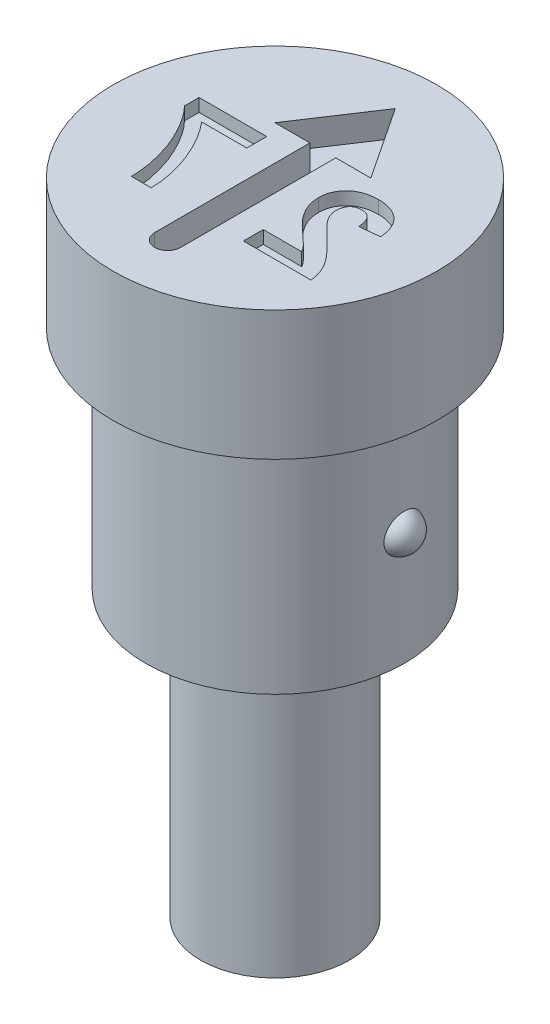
ISO-10303-21;
HEADER;
FILE_DESCRIPTION(('STEP AP214'),'2;1');
FILE_NAME('part.step','',(''),(''),'','','');
FILE_SCHEMA(('AUTOMOTIVE_DESIGN { 1 0 10303 214 1 1 1 1 }'));
ENDSEC;
DATA;
#1=APPLICATION_CONTEXT('core data for automotive mechanical design processes');
#2=APPLICATION_PROTOCOL_DEFINITION('international standard','automotive_design',2000,#1);
#3=PRODUCT_CONTEXT('',#1,'mechanical');
#4=PRODUCT('Part','Part','',(#3));
#5=PRODUCT_RELATED_PRODUCT_CATEGORY('part','',(#4));
#6=PRODUCT_DEFINITION_FORMATION('','',#4);
#7=PRODUCT_DEFINITION_CONTEXT('part definition',#1,'design');
#8=PRODUCT_DEFINITION('design','',#6,#7);
#9=PRODUCT_DEFINITION_SHAPE('','',#8);
#10=(LENGTH_UNIT() NAMED_UNIT(*) SI_UNIT(.MILLI.,.METRE.));
#11=(NAMED_UNIT(*) PLANE_ANGLE_UNIT() SI_UNIT($,.RADIAN.));
#12=(NAMED_UNIT(*) SI_UNIT($,.STERADIAN.) SOLID_ANGLE_UNIT());
#13=UNCERTAINTY_MEASURE_WITH_UNIT(LENGTH_MEASURE(1.E-05),#10,'distance_accuracy_value','');
#14=(GEOMETRIC_REPRESENTATION_CONTEXT(3) GLOBAL_UNCERTAINTY_ASSIGNED_CONTEXT((#13)) GLOBAL_UNIT_ASSIGNED_CONTEXT((#10,
#11,#12)) REPRESENTATION_CONTEXT('',''));
#15=CARTESIAN_POINT('',(0.,0.,0.));
#16=DIRECTION('',(0.,0.,1.));
#17=DIRECTION('',(1.,0.,0.));
#18=AXIS2_PLACEMENT_3D('',#15,#16,#17);
#19=CARTESIAN_POINT('',(0.,0.,0.));
#20=DIRECTION('',(0.,1.,0.));
#21=DIRECTION('',(0.,0.,1.));
#22=AXIS2_PLACEMENT_3D('',#19,#20,#21);
#23=CYLINDRICAL_SURFACE('',#22,2.);
#24=CARTESIAN_POINT('',(0.,-2.,0.));
#25=DIRECTION('',(0.,1.,0.));
#26=DIRECTION('',(0.,0.,1.));
#27=AXIS2_PLACEMENT_3D('',#24,#25,#26);
#28=CIRCLE('',#27,2.);
#29=CARTESIAN_POINT('',(0.,-2.,2.));
#30=VERTEX_POINT('',#29);
#31=EDGE_CURVE('E416',#30,#30,#28,.T.);
#32=ORIENTED_EDGE('',*,*,#31,.F.);
#33=EDGE_LOOP('',(#32));
#34=FACE_BOUND('',#33,.T.);
#35=CARTESIAN_POINT('',(0.,-5.5,0.));
#36=DIRECTION('',(0.,1.,0.));
#37=DIRECTION('',(0.,0.,1.));
#38=AXIS2_PLACEMENT_3D('',#35,#36,#37);
#39=CIRCLE('',#38,2.);
#40=CARTESIAN_POINT('',(0.,-5.5,2.));
#41=VERTEX_POINT('',#40);
#42=EDGE_CURVE('E413',#41,#41,#39,.T.);
#43=ORIENTED_EDGE('',*,*,#42,.T.);
#44=EDGE_LOOP('',(#43));
#45=FACE_BOUND('',#44,.T.);
#46=CARTESIAN_POINT('',(1.97831052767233,-3.75,-0.293747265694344));
#47=CARTESIAN_POINT('',(1.97831078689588,-3.76593641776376,-0.293746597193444));
#48=CARTESIAN_POINT('',(1.97851134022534,-3.78188224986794,-0.29240453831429));
#49=CARTESIAN_POINT('',(1.97929162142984,-3.81332622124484,-0.287074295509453));
#50=CARTESIAN_POINT('',(1.97987172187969,-3.82882390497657,-0.283083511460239));
#51=CARTESIAN_POINT('',(1.98134463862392,-3.85890937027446,-0.27258270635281));
#52=CARTESIAN_POINT('',(1.98223717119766,-3.87349796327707,-0.266074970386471));
#53=CARTESIAN_POINT('',(1.98423542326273,-3.90137759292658,-0.250737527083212));
#54=CARTESIAN_POINT('',(1.98534111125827,-3.91466882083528,-0.24190816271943));
#55=CARTESIAN_POINT('',(1.98765649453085,-3.93973249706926,-0.222085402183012));
#56=CARTESIAN_POINT('',(1.98886711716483,-3.95148847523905,-0.211071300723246));
#57=CARTESIAN_POINT('',(1.9912508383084,-3.97302293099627,-0.187251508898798));
#58=CARTESIAN_POINT('',(1.99242393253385,-3.982801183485,-0.174445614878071));
#59=CARTESIAN_POINT('',(1.99462788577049,-4.00030270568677,-0.147140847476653));
#60=CARTESIAN_POINT('',(1.99565562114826,-4.00798343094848,-0.132614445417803));
#61=CARTESIAN_POINT('',(1.9974297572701,-4.02084909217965,-0.102479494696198));
#62=CARTESIAN_POINT('',(1.99817613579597,-4.0260338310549,-0.0868708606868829));
#63=CARTESIAN_POINT('',(1.99931471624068,-4.03383375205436,-0.0547869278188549));
#64=CARTESIAN_POINT('',(1.99970198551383,-4.03641318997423,-0.0383027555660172));
#65=CARTESIAN_POINT('',(2.00006220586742,-4.03881469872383,-0.00513010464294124));
#66=CARTESIAN_POINT('',(2.0000351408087,-4.03863666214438,0.0115583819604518));
#67=CARTESIAN_POINT('',(1.99956837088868,-4.03551905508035,0.0447599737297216));
#68=CARTESIAN_POINT('',(1.99912646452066,-4.03256475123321,0.0612716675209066));
#69=CARTESIAN_POINT('',(1.99787587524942,-4.02394674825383,0.0935582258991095));
#70=CARTESIAN_POINT('',(1.99706718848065,-4.01828302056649,0.109333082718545));
#71=CARTESIAN_POINT('',(1.99517518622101,-4.00440082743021,0.139666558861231));
#72=CARTESIAN_POINT('',(1.99409233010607,-3.99618663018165,0.154227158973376));
#73=CARTESIAN_POINT('',(1.99177384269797,-3.97741235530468,0.181735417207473));
#74=CARTESIAN_POINT('',(1.9905382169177,-3.96685236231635,0.194683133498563));
#75=CARTESIAN_POINT('',(1.98806834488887,-3.94377921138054,0.218463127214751));
#76=CARTESIAN_POINT('',(1.98683419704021,-3.93128556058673,0.229314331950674));
#77=CARTESIAN_POINT('',(1.98449829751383,-3.90461571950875,0.248721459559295));
#78=CARTESIAN_POINT('',(1.98339653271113,-3.89043969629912,0.257277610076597));
#79=CARTESIAN_POINT('',(1.98147241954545,-3.86107070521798,0.271697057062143));
#80=CARTESIAN_POINT('',(1.98064550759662,-3.84589994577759,0.277604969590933));
#81=CARTESIAN_POINT('',(1.9793410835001,-3.81476131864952,0.286758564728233));
#82=CARTESIAN_POINT('',(1.97886353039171,-3.79879354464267,0.2900045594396));
#83=CARTESIAN_POINT('',(1.97831890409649,-3.76682346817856,0.293696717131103));
#84=CARTESIAN_POINT('',(1.97824458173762,-3.75082698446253,0.294192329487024));
#85=CARTESIAN_POINT('',(1.97849533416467,-3.71898025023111,0.292501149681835));
#86=CARTESIAN_POINT('',(1.97882038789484,-3.70312999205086,0.290314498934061));
#87=CARTESIAN_POINT('',(1.97982953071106,-3.67212862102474,0.283349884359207));
#88=CARTESIAN_POINT('',(1.98051132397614,-3.6569737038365,0.27858848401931));
#89=CARTESIAN_POINT('',(1.98215656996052,-3.62767461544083,0.26662997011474));
#90=CARTESIAN_POINT('',(1.98312003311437,-3.61353048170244,0.25943276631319));
#91=CARTESIAN_POINT('',(1.98523358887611,-3.58649756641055,0.242732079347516));
#92=CARTESIAN_POINT('',(1.98638543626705,-3.57362261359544,0.233206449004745));
#93=CARTESIAN_POINT('',(1.98874294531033,-3.54962508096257,0.212163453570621));
#94=CARTESIAN_POINT('',(1.98994861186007,-3.53850266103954,0.200645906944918));
#95=CARTESIAN_POINT('',(1.99230653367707,-3.51809999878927,0.175710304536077));
#96=CARTESIAN_POINT('',(1.99345736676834,-3.50885813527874,0.162260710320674));
#97=CARTESIAN_POINT('',(1.99555554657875,-3.49271435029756,0.134009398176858));
#98=CARTESIAN_POINT('',(1.99650287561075,-3.48581263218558,0.119207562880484));
#99=CARTESIAN_POINT('',(1.99810519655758,-3.47442614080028,0.0884132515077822));
#100=CARTESIAN_POINT('',(1.99875521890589,-3.46998221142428,0.0724054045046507));
#101=CARTESIAN_POINT('',(1.99966888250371,-3.46379408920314,0.0398652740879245));
#102=CARTESIAN_POINT('',(1.99993250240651,-3.46205004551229,0.0233329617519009));
#103=CARTESIAN_POINT('',(2.00004504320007,-3.46130149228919,-0.0099295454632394));
#104=CARTESIAN_POINT('',(1.99989058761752,-3.46231928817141,-0.0266602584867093));
#105=CARTESIAN_POINT('',(1.99917677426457,-3.46711715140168,-0.0597123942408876));
#106=CARTESIAN_POINT('',(1.99861740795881,-3.47089727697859,-0.0760338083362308));
#107=CARTESIAN_POINT('',(1.997155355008,-3.48112937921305,-0.107814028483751));
#108=CARTESIAN_POINT('',(1.9962524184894,-3.48758330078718,-0.12327219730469));
#109=CARTESIAN_POINT('',(1.99420468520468,-3.5029991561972,-0.152865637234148));
#110=CARTESIAN_POINT('',(1.99305989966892,-3.5119609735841,-0.16700096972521));
#111=CARTESIAN_POINT('',(1.9906669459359,-3.53209122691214,-0.19344378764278));
#112=CARTESIAN_POINT('',(1.98941951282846,-3.54324465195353,-0.205762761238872));
#113=CARTESIAN_POINT('',(1.98695768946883,-3.56749944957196,-0.228315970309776));
#114=CARTESIAN_POINT('',(1.98574330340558,-3.5806010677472,-0.23854994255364));
#115=CARTESIAN_POINT('',(1.98350679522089,-3.60817756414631,-0.25647901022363));
#116=CARTESIAN_POINT('',(1.9824821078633,-3.6226294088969,-0.264209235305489));
#117=CARTESIAN_POINT('',(1.98072359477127,-3.65264613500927,-0.277086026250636));
#118=CARTESIAN_POINT('',(1.97998943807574,-3.66820972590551,-0.282235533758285));
#119=CARTESIAN_POINT('',(1.97907239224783,-3.69487781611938,-0.288580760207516));
#120=CARTESIAN_POINT('',(1.97878817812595,-3.70580886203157,-0.290515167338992));
#121=CARTESIAN_POINT('',(1.97840715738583,-3.72782508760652,-0.293098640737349));
#122=CARTESIAN_POINT('',(1.97831034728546,-3.73891026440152,-0.293747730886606));
#123=CARTESIAN_POINT('',(1.97831052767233,-3.75,-0.293747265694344));
#124=B_SPLINE_CURVE_WITH_KNOTS('',3,(#46,#47,#48,#49,#50,#51,#52,#53,#54,#55,#56,#57,#58,#59,
#60,#61,#62,#63,#64,#65,#66,#67,#68,#69,#70,#71,#72,#73,#74,#75,#76,#77,#78,#79,#80,#81,#82,#83,
#84,#85,#86,#87,#88,#89,#90,#91,#92,#93,#94,#95,#96,#97,#98,#99,#100,#101,#102,#103,#104,#105,
#106,#107,#108,#109,#110,#111,#112,#113,#114,#115,#116,#117,#118,#119,#120,#121,#122,#123),
.UNSPECIFIED.,.T.,.F.,(4,2,2,2,2,2,2,2,2,2,2,2,2,2,2,2,2,2,2,2,2,2,2,2,2,2,2,2,2,2,2,2,2,2,2,2,
2,2,4),(0.,0.0477684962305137,0.0955839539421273,0.143356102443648,0.191121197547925,
0.239362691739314,0.287609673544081,0.336772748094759,0.385939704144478,0.435772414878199,
0.485607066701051,0.535707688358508,0.585808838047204,0.635826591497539,0.685842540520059,
0.735383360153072,0.784919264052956,0.833585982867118,0.882246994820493,0.930030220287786,
0.977810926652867,1.02528785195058,1.072766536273,1.12071570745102,1.16866925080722,
1.21752038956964,1.26637577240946,1.31602035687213,1.36566768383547,1.41571716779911,
1.46576770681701,1.51585471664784,1.56593940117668,1.61569230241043,1.6654514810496,
1.71447876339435,1.76345003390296,1.79669149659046,1.82993234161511),.UNSPECIFIED.);
#125=CARTESIAN_POINT('',(1.97831052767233,-3.75,-0.293747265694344));
#126=VERTEX_POINT('',#125);
#127=EDGE_CURVE('E41',#126,#126,#124,.T.);
#128=ORIENTED_EDGE('',*,*,#127,.T.);
#129=EDGE_LOOP('',(#128));
#130=FACE_BOUND('',#129,.T.);
#131=ADVANCED_FACE('F37',(#34,#45,#130),#23,.T.);
#132=CARTESIAN_POINT('',(0.,0.,0.));
#133=DIRECTION('',(0.,1.,0.));
#134=DIRECTION('',(0.,0.,1.));
#135=AXIS2_PLACEMENT_3D('',#132,#133,#134);
#136=PLANE('',#135);
#137=DIRECTION('',(-1.,0.,0.));
#138=VECTOR('',#137,1.);
#139=CARTESIAN_POINT('',(1.19363792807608,0.,0.780287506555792));
#140=LINE('',#139,#138);
#141=CARTESIAN_POINT('',(1.19363792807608,0.,0.780287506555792));
#142=VERTEX_POINT('',#141);
#143=CARTESIAN_POINT('',(0.599086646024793,0.,0.780287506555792));
#144=VERTEX_POINT('',#143);
#145=EDGE_CURVE('E58',#142,#144,#140,.T.);
#146=ORIENTED_EDGE('',*,*,#145,.F.);
#147=CARTESIAN_POINT('',(0.754214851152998,0.,0.324518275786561));
#148=CARTESIAN_POINT('',(0.75908140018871,0.,0.330647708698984));
#149=CARTESIAN_POINT('',(0.769504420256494,0.,0.343775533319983));
#150=CARTESIAN_POINT('',(0.78723671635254,0.,0.363905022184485));
#151=CARTESIAN_POINT('',(0.807786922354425,0.,0.385892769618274));
#152=CARTESIAN_POINT('',(0.830864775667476,0.,0.410150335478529));
#153=CARTESIAN_POINT('',(0.857232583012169,0.,0.435818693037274));
#154=CARTESIAN_POINT('',(0.885941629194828,0.,0.463971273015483));
#155=CARTESIAN_POINT('',(0.918255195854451,0.,0.493167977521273));
#156=CARTESIAN_POINT('',(0.951724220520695,0.,0.524137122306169));
#157=CARTESIAN_POINT('',(0.985338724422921,0.,0.554278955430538));
#158=CARTESIAN_POINT('',(1.01623529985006,0.,0.582907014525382));
#159=CARTESIAN_POINT('',(1.04429967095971,0.,0.608236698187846));
#160=CARTESIAN_POINT('',(1.06822482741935,0.,0.631666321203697));
#161=CARTESIAN_POINT('',(1.08941804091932,0.,0.651596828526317));
#162=CARTESIAN_POINT('',(1.10711543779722,0.,0.669050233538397));
#163=CARTESIAN_POINT('',(1.12164817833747,0.,0.683604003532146));
#164=CARTESIAN_POINT('',(1.14167335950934,0.,0.706289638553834));
#165=CARTESIAN_POINT('',(1.1671531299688,0.,0.73697196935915));
#166=CARTESIAN_POINT('',(1.18507919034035,0.,0.766289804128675));
#167=CARTESIAN_POINT('',(1.19363792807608,0.,0.780287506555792));
#168=B_SPLINE_CURVE_WITH_KNOTS('',3,(#147,#148,#149,#150,#151,#152,#153,#154,#155,#156,#157,
#158,#159,#160,#161,#162,#163,#164,#165,#166,#167),.UNSPECIFIED.,.F.,.F.,(4,1,1,1,1,1,1,1,1,1,1,
1,1,1,1,1,1,1,4),(0.,0.0369753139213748,0.0791925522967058,0.126700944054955,0.17918407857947,
0.23736864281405,0.300558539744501,0.369153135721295,0.443112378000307,0.516018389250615,
0.582473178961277,0.642136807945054,0.694619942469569,0.740679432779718,0.779589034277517,
0.812073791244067,0.837814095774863,0.922564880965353,1.),.UNSPECIFIED.);
#169=CARTESIAN_POINT('',(0.754214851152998,0.,0.324518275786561));
#170=VERTEX_POINT('',#169);
#171=EDGE_CURVE('E243',#170,#142,#168,.T.);
#172=ORIENTED_EDGE('',*,*,#171,.F.);
#173=CARTESIAN_POINT('',(0.599086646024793,0.,-0.0767637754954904));
#174=CARTESIAN_POINT('',(0.599478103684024,0.,-0.0593230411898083));
#175=CARTESIAN_POINT('',(0.600254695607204,0.,-0.0247233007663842));
#176=CARTESIAN_POINT('',(0.607689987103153,0.,0.0264254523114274));
#177=CARTESIAN_POINT('',(0.619049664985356,0.,0.0763947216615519));
#178=CARTESIAN_POINT('',(0.635838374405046,0.,0.125306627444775));
#179=CARTESIAN_POINT('',(0.657119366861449,0.,0.174334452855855));
#180=CARTESIAN_POINT('',(0.68455107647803,0.,0.223588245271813));
#181=CARTESIAN_POINT('',(0.716401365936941,0.,0.274553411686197));
#182=CARTESIAN_POINT('',(0.741338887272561,0.,0.307504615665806));
#183=CARTESIAN_POINT('',(0.754214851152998,0.,0.324518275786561));
#184=B_SPLINE_CURVE_WITH_KNOTS('',3,(#173,#174,#175,#176,#177,#178,#179,#180,#181,#182,#183),
.UNSPECIFIED.,.F.,.F.,(4,1,1,1,1,1,1,1,4),(0.,0.119176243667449,0.236427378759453,
0.352663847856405,0.469086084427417,0.589462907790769,0.717601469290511,0.854189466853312,1.),.UNSPECIFIED.);
#185=CARTESIAN_POINT('',(0.599086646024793,0.,-0.0767637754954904));
#186=VERTEX_POINT('',#185);
#187=EDGE_CURVE('E246',#186,#170,#184,.T.);
#188=ORIENTED_EDGE('',*,*,#187,.F.);
#189=CARTESIAN_POINT('',(1.09011228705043,0.,-0.512020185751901));
#190=CARTESIAN_POINT('',(1.07150877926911,0.,-0.511662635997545));
#191=CARTESIAN_POINT('',(1.03527611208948,0.,-0.510966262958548));
#192=CARTESIAN_POINT('',(0.982382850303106,0.,-0.505215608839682));
#193=CARTESIAN_POINT('',(0.932693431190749,0.,-0.495188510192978));
#194=CARTESIAN_POINT('',(0.885773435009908,0.,-0.481906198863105));
#195=CARTESIAN_POINT('',(0.84210470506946,0.,-0.464173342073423));
#196=CARTESIAN_POINT('',(0.801323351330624,0.,-0.442735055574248));
#197=CARTESIAN_POINT('',(0.764071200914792,0.,-0.416777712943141));
#198=CARTESIAN_POINT('',(0.729792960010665,0.,-0.387716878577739));
#199=CARTESIAN_POINT('',(0.699150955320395,0.,-0.355759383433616));
#200=CARTESIAN_POINT('',(0.672311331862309,0.,-0.321671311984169));
#201=CARTESIAN_POINT('',(0.649825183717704,0.,-0.285476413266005));
#202=CARTESIAN_POINT('',(0.630955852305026,0.,-0.247615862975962));
#203=CARTESIAN_POINT('',(0.616945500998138,0.,-0.207480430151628));
#204=CARTESIAN_POINT('',(0.606736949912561,0.,-0.165625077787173));
#205=CARTESIAN_POINT('',(0.599968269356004,0.,-0.121854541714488));
#206=CARTESIAN_POINT('',(0.599383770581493,0.,-0.0919602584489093));
#207=CARTESIAN_POINT('',(0.599086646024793,0.,-0.0767637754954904));
#208=B_SPLINE_CURVE_WITH_KNOTS('',3,(#189,#190,#191,#192,#193,#194,#195,#196,#197,#198,#199,
#200,#201,#202,#203,#204,#205,#206,#207),.UNSPECIFIED.,.F.,.F.,(4,1,1,1,1,1,1,1,1,1,1,1,1,1,1,1,
4),(0.,0.0756723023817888,0.147381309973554,0.216084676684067,0.28169803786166,
0.345459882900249,0.407485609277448,0.46873129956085,0.529782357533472,0.590032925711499,
0.648548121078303,0.70595351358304,0.763101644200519,0.820289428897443,0.878479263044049,
0.938226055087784,1.),.UNSPECIFIED.);
#209=CARTESIAN_POINT('',(1.09011228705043,0.,-0.512020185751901));
#210=VERTEX_POINT('',#209);
#211=EDGE_CURVE('E552',#210,#186,#208,.T.);
#212=ORIENTED_EDGE('',*,*,#211,.F.);
#213=CARTESIAN_POINT('',(1.604214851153,0.,-0.0293278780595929));
#214=CARTESIAN_POINT('',(1.60174105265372,0.,-0.0501009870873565));
#215=CARTESIAN_POINT('',(1.59694475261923,0.,-0.0903767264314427));
#216=CARTESIAN_POINT('',(1.58497550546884,0.,-0.148226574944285));
#217=CARTESIAN_POINT('',(1.56981689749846,0.,-0.201595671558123));
#218=CARTESIAN_POINT('',(1.55074626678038,0.,-0.250384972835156));
#219=CARTESIAN_POINT('',(1.52855182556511,0.,-0.294904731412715));
#220=CARTESIAN_POINT('',(1.5021014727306,0.,-0.334486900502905));
#221=CARTESIAN_POINT('',(1.47231941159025,0.,-0.369569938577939));
#222=CARTESIAN_POINT('',(1.43917990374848,0.,-0.400135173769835));
#223=CARTESIAN_POINT('',(1.40289362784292,0.,-0.426279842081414));
#224=CARTESIAN_POINT('',(1.36481769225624,0.,-0.449617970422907));
#225=CARTESIAN_POINT('',(1.3242079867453,0.,-0.468762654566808));
#226=CARTESIAN_POINT('',(1.28151162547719,0.,-0.484540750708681));
#227=CARTESIAN_POINT('',(1.23674790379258,0.,-0.49715047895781));
#228=CARTESIAN_POINT('',(1.18970978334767,0.,-0.505487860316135));
#229=CARTESIAN_POINT('',(1.14068756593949,0.,-0.511352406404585));
#230=CARTESIAN_POINT('',(1.10722479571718,0.,-0.511794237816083));
#231=CARTESIAN_POINT('',(1.09011228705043,0.,-0.512020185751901));
#232=B_SPLINE_CURVE_WITH_KNOTS('',3,(#213,#214,#215,#216,#217,#218,#219,#220,#221,#222,#223,
#224,#225,#226,#227,#228,#229,#230,#231),.UNSPECIFIED.,.F.,.F.,(4,1,1,1,1,1,1,1,1,1,1,1,1,1,1,1,
4),(0.,0.0794357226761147,0.154013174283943,0.224141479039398,0.289934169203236,
0.352732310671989,0.41272577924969,0.470302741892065,0.527168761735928,0.583502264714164,
0.639948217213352,0.696584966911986,0.753726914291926,0.812707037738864,0.872963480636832,
0.93503486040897,1.),.UNSPECIFIED.);
#233=CARTESIAN_POINT('',(1.604214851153,0.,-0.0293278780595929));
#234=VERTEX_POINT('',#233);
#235=EDGE_CURVE('E560',#234,#210,#232,.T.);
#236=ORIENTED_EDGE('',*,*,#235,.F.);
#237=DIRECTION('',(0.995240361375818,0.,-0.0974506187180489));
#238=VECTOR('',#237,1.);
#239=CARTESIAN_POINT('',(1.29652254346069,0.,0.00080032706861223));
#240=LINE('',#239,#238);
#241=CARTESIAN_POINT('',(1.29652254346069,0.,0.00080032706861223));
#242=VERTEX_POINT('',#241);
#243=EDGE_CURVE('E568',#242,#234,#240,.T.);
#244=ORIENTED_EDGE('',*,*,#243,.F.);
#245=CARTESIAN_POINT('',(1.09652254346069,0.,-0.245353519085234));
#246=CARTESIAN_POINT('',(1.11047812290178,0.,-0.244721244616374));
#247=CARTESIAN_POINT('',(1.13743728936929,0.,-0.243499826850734));
#248=CARTESIAN_POINT('',(1.17575211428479,0.,-0.232829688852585));
#249=CARTESIAN_POINT('',(1.20927051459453,0.,-0.214358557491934));
#250=CARTESIAN_POINT('',(1.23315750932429,0.,-0.193308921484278));
#251=CARTESIAN_POINT('',(1.24929430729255,0.,-0.172839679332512));
#252=CARTESIAN_POINT('',(1.26028935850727,0.,-0.155002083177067));
#253=CARTESIAN_POINT('',(1.26976623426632,0.,-0.134733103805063));
#254=CARTESIAN_POINT('',(1.27816353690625,0.,-0.112260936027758));
#255=CARTESIAN_POINT('',(1.2847964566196,0.,-0.0873281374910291));
#256=CARTESIAN_POINT('',(1.29013819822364,0.,-0.0601245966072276));
#257=CARTESIAN_POINT('',(1.29444286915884,0.,-0.0305039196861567));
#258=CARTESIAN_POINT('',(1.29581183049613,0.,-0.00989766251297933));
#259=CARTESIAN_POINT('',(1.29652254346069,0.,0.00080032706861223));
#260=B_SPLINE_CURVE_WITH_KNOTS('',3,(#245,#246,#247,#248,#249,#250,#251,#252,#253,#254,#255,
#256,#257,#258,#259),.UNSPECIFIED.,.F.,.F.,(4,1,1,1,1,1,1,1,1,1,1,1,4),(0.,0.116899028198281,
0.225823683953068,0.330086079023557,0.435451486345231,0.490306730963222,0.548244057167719,
0.610766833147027,0.677675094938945,0.749188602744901,0.826858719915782,0.910111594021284,1.),.UNSPECIFIED.);
#261=CARTESIAN_POINT('',(1.09652254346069,0.,-0.245353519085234));
#262=VERTEX_POINT('',#261);
#263=EDGE_CURVE('E574',#262,#242,#260,.T.);
#264=ORIENTED_EDGE('',*,*,#263,.F.);
#265=CARTESIAN_POINT('',(0.9067789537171,0.,-0.0354176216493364));
#266=CARTESIAN_POINT('',(0.907355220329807,0.,-0.0513814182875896));
#267=CARTESIAN_POINT('',(0.908445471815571,0.,-0.0815836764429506));
#268=CARTESIAN_POINT('',(0.917587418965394,0.,-0.12420464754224));
#269=CARTESIAN_POINT('',(0.933799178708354,0.,-0.160843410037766));
#270=CARTESIAN_POINT('',(0.956119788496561,0.,-0.191612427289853));
#271=CARTESIAN_POINT('',(0.984344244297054,0.,-0.215719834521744));
#272=CARTESIAN_POINT('',(1.0173394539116,0.,-0.233532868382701));
#273=CARTESIAN_POINT('',(1.0555884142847,0.,-0.243381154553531));
#274=CARTESIAN_POINT('',(1.08247204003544,0.,-0.244676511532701));
#275=CARTESIAN_POINT('',(1.09652254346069,0.,-0.245353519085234));
#276=B_SPLINE_CURVE_WITH_KNOTS('',3,(#265,#266,#267,#268,#269,#270,#271,#272,#273,#274,#275),
.UNSPECIFIED.,.F.,.F.,(4,1,1,1,1,1,1,1,4),(0.,0.149140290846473,0.282161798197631,
0.404655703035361,0.521109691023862,0.634416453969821,0.748796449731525,0.868710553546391,1.),.UNSPECIFIED.);
#277=CARTESIAN_POINT('',(0.9067789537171,0.,-0.0354176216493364));
#278=VERTEX_POINT('',#277);
#279=EDGE_CURVE('E579',#278,#262,#276,.T.);
#280=ORIENTED_EDGE('',*,*,#279,.F.);
#281=CARTESIAN_POINT('',(0.967676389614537,0.,0.149518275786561));
#282=CARTESIAN_POINT('',(0.958412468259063,0.,0.13412991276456));
#283=CARTESIAN_POINT('',(0.940543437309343,0.,0.10444754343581));
#284=CARTESIAN_POINT('',(0.920948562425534,0.,0.0577714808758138));
#285=CARTESIAN_POINT('',(0.909186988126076,0.,0.0111050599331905));
#286=CARTESIAN_POINT('',(0.90757298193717,0.,-0.0200771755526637));
#287=CARTESIAN_POINT('',(0.9067789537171,0.,-0.0354176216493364));
#288=B_SPLINE_CURVE_WITH_KNOTS('',3,(#281,#282,#283,#284,#285,#286,#287),.UNSPECIFIED.,.F.,.F.,
(4,1,1,1,4),(0.,0.272795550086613,0.526191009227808,0.766904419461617,1.),.UNSPECIFIED.);
#289=CARTESIAN_POINT('',(0.967676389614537,0.,0.149518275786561));
#290=VERTEX_POINT('',#289);
#291=EDGE_CURVE('E587',#290,#278,#288,.T.);
#292=ORIENTED_EDGE('',*,*,#291,.F.);
#293=CARTESIAN_POINT('',(1.21254818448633,0.,0.407851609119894));
#294=CARTESIAN_POINT('',(1.19672893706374,0.,0.392581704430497));
#295=CARTESIAN_POINT('',(1.16661374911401,0.,0.363512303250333));
#296=CARTESIAN_POINT('',(1.12372966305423,0.,0.321886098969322));
#297=CARTESIAN_POINT('',(1.0860301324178,0.,0.283619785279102));
#298=CARTESIAN_POINT('',(1.0527269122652,0.,0.249705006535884));
#299=CARTESIAN_POINT('',(1.02458935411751,0.,0.21927820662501));
#300=CARTESIAN_POINT('',(1.00124733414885,0.,0.19281723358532));
#301=CARTESIAN_POINT('',(0.982405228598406,0.,0.170214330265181));
#302=CARTESIAN_POINT('',(0.972200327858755,0.,0.155875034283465));
#303=CARTESIAN_POINT('',(0.967676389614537,0.,0.149518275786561));
#304=B_SPLINE_CURVE_WITH_KNOTS('',3,(#293,#294,#295,#296,#297,#298,#299,#300,#301,#302,#303),
.UNSPECIFIED.,.F.,.F.,(4,1,1,1,1,1,1,1,4),(0.,0.18509006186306,0.352356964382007,
0.503079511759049,0.637279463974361,0.752473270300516,0.851885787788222,0.934339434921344,1.),.UNSPECIFIED.);
#305=CARTESIAN_POINT('',(1.21254818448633,0.,0.407851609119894));
#306=VERTEX_POINT('',#305);
#307=EDGE_CURVE('E595',#306,#290,#304,.T.);
#308=ORIENTED_EDGE('',*,*,#307,.F.);
#309=CARTESIAN_POINT('',(1.64524049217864,0.,1.0879798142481));
#310=CARTESIAN_POINT('',(1.64169845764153,0.,1.0616830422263));
#311=CARTESIAN_POINT('',(1.63461637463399,0.,1.00910424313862));
#312=CARTESIAN_POINT('',(1.6127211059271,0.,0.932299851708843));
#313=CARTESIAN_POINT('',(1.58349842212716,0.,0.857351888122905));
#314=CARTESIAN_POINT('',(1.55178274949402,0.,0.79636243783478));
#315=CARTESIAN_POINT('',(1.52023800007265,0.,0.747268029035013));
#316=CARTESIAN_POINT('',(1.49161744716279,0.,0.707039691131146));
#317=CARTESIAN_POINT('',(1.45747417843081,0.,0.664238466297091));
#318=CARTESIAN_POINT('',(1.4183036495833,0.,0.618518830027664));
#319=CARTESIAN_POINT('',(1.37432233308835,0.,0.569737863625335));
#320=CARTESIAN_POINT('',(1.32520209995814,0.,0.518076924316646));
#321=CARTESIAN_POINT('',(1.27070863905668,0.,0.463783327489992));
#322=CARTESIAN_POINT('',(1.23237151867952,0.,0.426915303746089));
#323=CARTESIAN_POINT('',(1.21254818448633,0.,0.407851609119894));
#324=B_SPLINE_CURVE_WITH_KNOTS('',3,(#309,#310,#311,#312,#313,#314,#315,#316,#317,#318,#319,
#320,#321,#322,#323),.UNSPECIFIED.,.F.,.F.,(4,1,1,1,1,1,1,1,1,1,1,1,4),(0.,0.0963574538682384,
0.192660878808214,0.289454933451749,0.388479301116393,0.441921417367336,0.501521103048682,
0.567882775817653,0.640891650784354,0.72037065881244,0.806636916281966,0.900015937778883,1.),.UNSPECIFIED.);
#325=CARTESIAN_POINT('',(1.64524049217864,0.,1.0879798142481));
#326=VERTEX_POINT('',#325);
#327=EDGE_CURVE('E603',#326,#306,#324,.T.);
#328=ORIENTED_EDGE('',*,*,#327,.F.);
#329=DIRECTION('',(1.,0.,0.));
#330=VECTOR('',#329,1.);
#331=CARTESIAN_POINT('',(0.599086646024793,0.,1.0879798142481));
#332=LINE('',#331,#330);
#333=CARTESIAN_POINT('',(0.599086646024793,0.,1.0879798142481));
#334=VERTEX_POINT('',#333);
#335=EDGE_CURVE('E611',#334,#326,#332,.T.);
#336=ORIENTED_EDGE('',*,*,#335,.F.);
#337=DIRECTION('',(0.,0.,1.));
#338=VECTOR('',#337,1.);
#339=CARTESIAN_POINT('',(0.599086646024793,0.,0.780287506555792));
#340=LINE('',#339,#338);
#341=EDGE_CURVE('E617',#144,#334,#340,.T.);
#342=ORIENTED_EDGE('',*,*,#341,.F.);
#343=EDGE_LOOP('',(#146,#172,#188,#212,#236,#244,#264,#280,#292,#308,#328,#336,#342));
#344=FACE_BOUND('',#343,.T.);
#345=DIRECTION('',(1.,0.,0.));
#346=VECTOR('',#345,1.);
#347=CARTESIAN_POINT('',(-1.31713130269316,0.,-0.183815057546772));
#348=LINE('',#347,#346);
#349=CARTESIAN_POINT('',(-1.31713130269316,0.,-0.183815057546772));
#350=VERTEX_POINT('',#349);
#351=CARTESIAN_POINT('',(-0.619374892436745,0.,-0.183815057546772));
#352=VERTEX_POINT('',#351);
#353=EDGE_CURVE('E66',#350,#352,#348,.T.);
#354=ORIENTED_EDGE('',*,*,#353,.F.);
#355=CARTESIAN_POINT('',(-0.824503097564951,0.,1.0879798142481));
#356=CARTESIAN_POINT('',(-0.825531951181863,0.,1.06072188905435));
#357=CARTESIAN_POINT('',(-0.827601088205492,0.,1.00590322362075));
#358=CARTESIAN_POINT('',(-0.835342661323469,0.,0.923622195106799));
#359=CARTESIAN_POINT('',(-0.847501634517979,0.,0.841034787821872));
#360=CARTESIAN_POINT('',(-0.862603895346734,0.,0.757950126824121));
#361=CARTESIAN_POINT('',(-0.882542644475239,0.,0.674570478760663));
#362=CARTESIAN_POINT('',(-0.905298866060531,0.,0.590586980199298));
#363=CARTESIAN_POINT('',(-0.932864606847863,0.,0.506448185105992));
#364=CARTESIAN_POINT('',(-0.963765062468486,0.,0.422314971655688));
#365=CARTESIAN_POINT('',(-0.997877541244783,0.,0.338986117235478));
#366=CARTESIAN_POINT('',(-1.03505534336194,0.,0.257495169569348));
#367=CARTESIAN_POINT('',(-1.07520236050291,0.,0.178350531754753));
#368=CARTESIAN_POINT('',(-1.11779648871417,0.,0.101274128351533));
#369=CARTESIAN_POINT('',(-1.16333324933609,0.,0.0265139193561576));
#370=CARTESIAN_POINT('',(-1.21184692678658,0.,-0.0458489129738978));
#371=CARTESIAN_POINT('',(-1.26264936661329,0.,-0.116337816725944));
#372=CARTESIAN_POINT('',(-1.29897371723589,0.,-0.161326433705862));
#373=CARTESIAN_POINT('',(-1.31713130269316,0.,-0.183815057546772));
#374=B_SPLINE_CURVE_WITH_KNOTS('',3,(#355,#356,#357,#358,#359,#360,#361,#362,#363,#364,#365,
#366,#367,#368,#369,#370,#371,#372,#373),.UNSPECIFIED.,.F.,.F.,(4,1,1,1,1,1,1,1,1,1,1,1,1,1,1,1,
4),(0.,0.0589531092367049,0.118561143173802,0.178522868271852,0.239353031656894,
0.301026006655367,0.363773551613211,0.427382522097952,0.492333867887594,0.557475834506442,
0.621960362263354,0.685889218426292,0.749254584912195,0.812267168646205,0.875035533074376,
0.937533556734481,1.),.UNSPECIFIED.);
#375=CARTESIAN_POINT('',(-0.824503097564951,0.,1.0879798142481));
#376=VERTEX_POINT('',#375);
#377=EDGE_CURVE('E328',#376,#350,#374,.T.);
#378=ORIENTED_EDGE('',*,*,#377,.F.);
#379=DIRECTION('',(1.,0.,0.));
#380=VECTOR('',#379,1.);
#381=CARTESIAN_POINT('',(-1.13219540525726,0.,1.0879798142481));
#382=LINE('',#381,#380);
#383=CARTESIAN_POINT('',(-1.13219540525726,0.,1.0879798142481));
#384=VERTEX_POINT('',#383);
#385=EDGE_CURVE('E322',#384,#376,#382,.T.);
#386=ORIENTED_EDGE('',*,*,#385,.F.);
#387=CARTESIAN_POINT('',(-1.66552873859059,0.,-0.265866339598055));
#388=CARTESIAN_POINT('',(-1.65461537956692,0.,-0.254762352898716));
#389=CARTESIAN_POINT('',(-1.63218064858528,0.,-0.231935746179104));
#390=CARTESIAN_POINT('',(-1.60004509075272,0.,-0.194577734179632));
#391=CARTESIAN_POINT('',(-1.56743340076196,0.,-0.154037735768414));
#392=CARTESIAN_POINT('',(-1.53502752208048,0.,-0.109769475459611));
#393=CARTESIAN_POINT('',(-1.50182013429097,0.,-0.0624722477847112));
#394=CARTESIAN_POINT('',(-1.46927058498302,0.,-0.011239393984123));
#395=CARTESIAN_POINT('',(-1.4362580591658,0.,0.0432644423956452));
#396=CARTESIAN_POINT('',(-1.39181276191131,0.,0.120360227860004));
#397=CARTESIAN_POINT('',(-1.33986175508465,0.,0.221071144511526));
#398=CARTESIAN_POINT('',(-1.28490033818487,0.,0.346259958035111));
#399=CARTESIAN_POINT('',(-1.23807572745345,0.,0.475293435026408));
#400=CARTESIAN_POINT('',(-1.20601228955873,0.,0.585239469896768));
#401=CARTESIAN_POINT('',(-1.1843482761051,0.,0.673361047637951));
#402=CARTESIAN_POINT('',(-1.1701940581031,0.,0.737797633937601));
#403=CARTESIAN_POINT('',(-1.1582792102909,0.,0.800420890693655));
#404=CARTESIAN_POINT('',(-1.14858648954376,0.,0.861340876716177));
#405=CARTESIAN_POINT('',(-1.14135253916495,0.,0.920585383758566));
#406=CARTESIAN_POINT('',(-1.1356364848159,0.,0.977948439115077));
#407=CARTESIAN_POINT('',(-1.13281642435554,0.,1.03356992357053));
#408=CARTESIAN_POINT('',(-1.13240029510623,0.,1.0700286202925));
#409=CARTESIAN_POINT('',(-1.13219540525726,0.,1.0879798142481));
#410=B_SPLINE_CURVE_WITH_KNOTS('',3,(#387,#388,#389,#390,#391,#392,#393,#394,#395,#396,#397,
#398,#399,#400,#401,#402,#403,#404,#405,#406,#407,#408,#409),.UNSPECIFIED.,.F.,.F.,(4,1,1,1,1,1,
1,1,1,1,1,1,1,1,1,1,1,1,1,1,4),(0.,0.0314272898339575,0.0646054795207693,0.0994393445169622,
0.136456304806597,0.175351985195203,0.216100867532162,0.258977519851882,0.304007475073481,
0.395756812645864,0.487615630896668,0.579873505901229,0.672707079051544,0.718694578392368,
0.76307923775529,0.805893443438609,0.847386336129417,0.88760014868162,0.926386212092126,
0.963754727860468,1.),.UNSPECIFIED.);
#411=CARTESIAN_POINT('',(-1.66552873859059,0.,-0.265866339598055));
#412=VERTEX_POINT('',#411);
#413=EDGE_CURVE('E317',#412,#384,#410,.T.);
#414=ORIENTED_EDGE('',*,*,#413,.F.);
#415=DIRECTION('',(0.,0.,1.));
#416=VECTOR('',#415,1.);
#417=CARTESIAN_POINT('',(-1.66552873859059,0.,-0.49150736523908));
#418=LINE('',#417,#416);
#419=CARTESIAN_POINT('',(-1.66552873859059,0.,-0.49150736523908));
#420=VERTEX_POINT('',#419);
#421=EDGE_CURVE('E314',#420,#412,#418,.T.);
#422=ORIENTED_EDGE('',*,*,#421,.F.);
#423=DIRECTION('',(-1.,0.,0.));
#424=VECTOR('',#423,1.);
#425=CARTESIAN_POINT('',(-0.619374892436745,0.,-0.49150736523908));
#426=LINE('',#425,#424);
#427=CARTESIAN_POINT('',(-0.619374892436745,0.,-0.49150736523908));
#428=VERTEX_POINT('',#427);
#429=EDGE_CURVE('E311',#428,#420,#426,.T.);
#430=ORIENTED_EDGE('',*,*,#429,.F.);
#431=DIRECTION('',(0.,0.,-1.));
#432=VECTOR('',#431,1.);
#433=CARTESIAN_POINT('',(-0.619374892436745,0.,-0.183815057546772));
#434=LINE('',#433,#432);
#435=EDGE_CURVE('E308',#352,#428,#434,.T.);
#436=ORIENTED_EDGE('',*,*,#435,.F.);
#437=EDGE_LOOP('',(#354,#378,#386,#414,#422,#430,#436));
#438=FACE_BOUND('',#437,.T.);
#439=DIRECTION('',(-0.551936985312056,0.,-0.833885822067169));
#440=VECTOR('',#439,1.);
#441=CARTESIAN_POINT('',(0.741311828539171,0.,-0.74));
#442=LINE('',#441,#440);
#443=CARTESIAN_POINT('',(0.741311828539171,0.,-0.74));
#444=VERTEX_POINT('',#443);
#445=CARTESIAN_POINT('',(0.,0.,-1.86));
#446=VERTEX_POINT('',#445);
#447=EDGE_CURVE('E373',#444,#446,#442,.T.);
#448=ORIENTED_EDGE('',*,*,#447,.F.);
#449=DIRECTION('',(1.,0.,0.));
#450=VECTOR('',#449,1.);
#451=CARTESIAN_POINT('',(0.2,0.,-0.74));
#452=LINE('',#451,#450);
#453=CARTESIAN_POINT('',(0.2,0.,-0.74));
#454=VERTEX_POINT('',#453);
#455=EDGE_CURVE('E354',#454,#444,#452,.T.);
#456=ORIENTED_EDGE('',*,*,#455,.F.);
#457=DIRECTION('',(0.,0.,-1.));
#458=VECTOR('',#457,1.);
#459=CARTESIAN_POINT('',(0.200000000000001,0.,1.66));
#460=LINE('',#459,#458);
#461=CARTESIAN_POINT('',(0.2,0.,1.66));
#462=VERTEX_POINT('',#461);
#463=EDGE_CURVE('E388',#462,#454,#460,.T.);
#464=ORIENTED_EDGE('',*,*,#463,.F.);
#465=CARTESIAN_POINT('',(0.,0.,1.66));
#466=DIRECTION('',(0.,1.,0.));
#467=DIRECTION('',(0.,0.,1.));
#468=AXIS2_PLACEMENT_3D('',#465,#466,#467);
#469=CIRCLE('',#468,0.200000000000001);
#470=CARTESIAN_POINT('',(-0.2,0.,1.66));
#471=VERTEX_POINT('',#470);
#472=EDGE_CURVE('E385',#471,#462,#469,.T.);
#473=ORIENTED_EDGE('',*,*,#472,.F.);
#474=DIRECTION('',(0.,0.,1.));
#475=VECTOR('',#474,1.);
#476=CARTESIAN_POINT('',(-0.200000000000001,0.,-0.74));
#477=LINE('',#476,#475);
#478=CARTESIAN_POINT('',(-0.200000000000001,0.,-0.74));
#479=VERTEX_POINT('',#478);
#480=EDGE_CURVE('E382',#479,#471,#477,.T.);
#481=ORIENTED_EDGE('',*,*,#480,.F.);
#482=DIRECTION('',(1.,0.,0.));
#483=VECTOR('',#482,1.);
#484=CARTESIAN_POINT('',(-0.741311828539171,0.,-0.74));
#485=LINE('',#484,#483);
#486=CARTESIAN_POINT('',(-0.741311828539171,0.,-0.74));
#487=VERTEX_POINT('',#486);
#488=EDGE_CURVE('E379',#487,#479,#485,.T.);
#489=ORIENTED_EDGE('',*,*,#488,.F.);
#490=DIRECTION('',(-0.551936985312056,0.,0.83388582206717));
#491=VECTOR('',#490,1.);
#492=CARTESIAN_POINT('',(0.,0.,-1.86));
#493=LINE('',#492,#491);
#494=EDGE_CURVE('E375',#446,#487,#493,.T.);
#495=ORIENTED_EDGE('',*,*,#494,.F.);
#496=EDGE_LOOP('',(#448,#456,#464,#473,#481,#489,#495));
#497=FACE_BOUND('',#496,.T.);
#498=CARTESIAN_POINT('',(0.,0.,0.));
#499=DIRECTION('',(0.,1.,0.));
#500=DIRECTION('',(0.,0.,1.));
#501=AXIS2_PLACEMENT_3D('',#498,#499,#500);
#502=CIRCLE('',#501,2.5);
#503=CARTESIAN_POINT('',(0.,0.,2.5));
#504=VERTEX_POINT('',#503);
#505=EDGE_CURVE('E11',#504,#504,#502,.T.);
#506=ORIENTED_EDGE('',*,*,#505,.T.);
#507=EDGE_LOOP('',(#506));
#508=FACE_BOUND('',#507,.T.);
#509=ADVANCED_FACE('F39',(#344,#438,#497,#508),#136,.T.);
#510=CARTESIAN_POINT('',(0.,0.,0.));
#511=DIRECTION('',(0.,1.,0.));
#512=DIRECTION('',(0.,0.,1.));
#513=AXIS2_PLACEMENT_3D('',#510,#511,#512);
#514=CYLINDRICAL_SURFACE('',#513,2.5);
#515=CARTESIAN_POINT('',(0.,-2.,0.));
#516=DIRECTION('',(0.,1.,0.));
#517=DIRECTION('',(0.,0.,1.));
#518=AXIS2_PLACEMENT_3D('',#515,#516,#517);
#519=CIRCLE('',#518,2.5);
#520=CARTESIAN_POINT('',(0.,-2.,2.5));
#521=VERTEX_POINT('',#520);
#522=EDGE_CURVE('E51',#521,#521,#519,.T.);
#523=ORIENTED_EDGE('',*,*,#522,.T.);
#524=EDGE_LOOP('',(#523));
#525=FACE_BOUND('',#524,.T.);
#526=ORIENTED_EDGE('',*,*,#505,.F.);
#527=EDGE_LOOP('',(#526));
#528=FACE_BOUND('',#527,.T.);
#529=ADVANCED_FACE('F422',(#525,#528),#514,.T.);
#530=CARTESIAN_POINT('',(-2.5,-2.,0.));
#531=DIRECTION('',(0.,-1.,0.));
#532=DIRECTION('',(0.,0.,-1.));
#533=AXIS2_PLACEMENT_3D('',#530,#531,#532);
#534=PLANE('',#533);
#535=ORIENTED_EDGE('',*,*,#31,.T.);
#536=EDGE_LOOP('',(#535));
#537=FACE_BOUND('',#536,.T.);
#538=ORIENTED_EDGE('',*,*,#522,.F.);
#539=EDGE_LOOP('',(#538));
#540=FACE_BOUND('',#539,.T.);
#541=ADVANCED_FACE('F425',(#537,#540),#534,.T.);
#542=CARTESIAN_POINT('',(-2.,-5.5,0.));
#543=DIRECTION('',(0.,-1.,0.));
#544=DIRECTION('',(0.,0.,-1.));
#545=AXIS2_PLACEMENT_3D('',#542,#543,#544);
#546=PLANE('',#545);
#547=CARTESIAN_POINT('',(0.,-5.5,0.));
#548=DIRECTION('',(0.,1.,0.));
#549=DIRECTION('',(0.,0.,1.));
#550=AXIS2_PLACEMENT_3D('',#547,#548,#549);
#551=CIRCLE('',#550,1.15);
#552=CARTESIAN_POINT('',(0.,-5.5,1.15));
#553=VERTEX_POINT('',#552);
#554=EDGE_CURVE('E410',#553,#553,#551,.T.);
#555=ORIENTED_EDGE('',*,*,#554,.T.);
#556=EDGE_LOOP('',(#555));
#557=FACE_BOUND('',#556,.T.);
#558=ORIENTED_EDGE('',*,*,#42,.F.);
#559=EDGE_LOOP('',(#558));
#560=FACE_BOUND('',#559,.T.);
#561=ADVANCED_FACE('F427',(#557,#560),#546,.T.);
#562=CARTESIAN_POINT('',(0.,0.,0.));
#563=DIRECTION('',(0.,1.,0.));
#564=DIRECTION('',(0.,0.,1.));
#565=AXIS2_PLACEMENT_3D('',#562,#563,#564);
#566=CYLINDRICAL_SURFACE('',#565,1.15);
#567=CARTESIAN_POINT('',(0.,-9.9,0.));
#568=DIRECTION('',(0.,1.,0.));
#569=DIRECTION('',(0.,0.,1.));
#570=AXIS2_PLACEMENT_3D('',#567,#568,#569);
#571=CIRCLE('',#570,1.15);
#572=CARTESIAN_POINT('',(0.,-9.9,1.15));
#573=VERTEX_POINT('',#572);
#574=EDGE_CURVE('E395',#573,#573,#571,.T.);
#575=ORIENTED_EDGE('',*,*,#574,.T.);
#576=EDGE_LOOP('',(#575));
#577=FACE_BOUND('',#576,.T.);
#578=ORIENTED_EDGE('',*,*,#554,.F.);
#579=EDGE_LOOP('',(#578));
#580=FACE_BOUND('',#579,.T.);
#581=ADVANCED_FACE('F434',(#577,#580),#566,.T.);
#582=CARTESIAN_POINT('',(-1.15,-9.9,0.));
#583=DIRECTION('',(0.,-1.,0.));
#584=DIRECTION('',(0.,0.,-1.));
#585=AXIS2_PLACEMENT_3D('',#582,#583,#584);
#586=PLANE('',#585);
#587=ORIENTED_EDGE('',*,*,#574,.F.);
#588=EDGE_LOOP('',(#587));
#589=FACE_BOUND('',#588,.T.);
#590=ADVANCED_FACE('F449',(#589),#586,.T.);
#591=CARTESIAN_POINT('',(0.741311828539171,-0.4,-0.74));
#592=DIRECTION('',(0.833885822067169,0.,-0.551936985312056));
#593=DIRECTION('',(-0.551936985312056,0.,-0.833885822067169));
#594=AXIS2_PLACEMENT_3D('',#591,#592,#593);
#595=PLANE('',#594);
#596=ORIENTED_EDGE('',*,*,#447,.T.);
#597=DIRECTION('',(0.,1.,0.));
#598=VECTOR('',#597,1.);
#599=CARTESIAN_POINT('',(0.,-0.4,-1.86));
#600=LINE('',#599,#598);
#601=CARTESIAN_POINT('',(0.,-0.4,-1.86));
#602=VERTEX_POINT('',#601);
#603=EDGE_CURVE('E372',#602,#446,#600,.T.);
#604=ORIENTED_EDGE('',*,*,#603,.F.);
#605=DIRECTION('',(-0.551936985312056,0.,-0.833885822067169));
#606=VECTOR('',#605,1.);
#607=CARTESIAN_POINT('',(0.741311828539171,-0.4,-0.74));
#608=LINE('',#607,#606);
#609=CARTESIAN_POINT('',(0.741311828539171,-0.4,-0.74));
#610=VERTEX_POINT('',#609);
#611=EDGE_CURVE('E350',#610,#602,#608,.T.);
#612=ORIENTED_EDGE('',*,*,#611,.F.);
#613=DIRECTION('',(0.,1.,0.));
#614=VECTOR('',#613,1.);
#615=CARTESIAN_POINT('',(0.741311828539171,-0.4,-0.74));
#616=LINE('',#615,#614);
#617=EDGE_CURVE('E393',#610,#444,#616,.T.);
#618=ORIENTED_EDGE('',*,*,#617,.T.);
#619=EDGE_LOOP('',(#596,#604,#612,#618));
#620=FACE_BOUND('',#619,.T.);
#621=ADVANCED_FACE('F453',(#620),#595,.F.);
#622=CARTESIAN_POINT('',(0.2,-0.4,-0.74));
#623=DIRECTION('',(0.,0.,1.));
#624=DIRECTION('',(1.,0.,0.));
#625=AXIS2_PLACEMENT_3D('',#622,#623,#624);
#626=PLANE('',#625);
#627=ORIENTED_EDGE('',*,*,#455,.T.);
#628=ORIENTED_EDGE('',*,*,#617,.F.);
#629=DIRECTION('',(1.,0.,0.));
#630=VECTOR('',#629,1.);
#631=CARTESIAN_POINT('',(0.2,-0.4,-0.74));
#632=LINE('',#631,#630);
#633=CARTESIAN_POINT('',(0.2,-0.4,-0.74));
#634=VERTEX_POINT('',#633);
#635=EDGE_CURVE('E369',#634,#610,#632,.T.);
#636=ORIENTED_EDGE('',*,*,#635,.F.);
#637=DIRECTION('',(0.,1.,0.));
#638=VECTOR('',#637,1.);
#639=CARTESIAN_POINT('',(0.2,-0.4,-0.74));
#640=LINE('',#639,#638);
#641=EDGE_CURVE('E396',#634,#454,#640,.T.);
#642=ORIENTED_EDGE('',*,*,#641,.T.);
#643=EDGE_LOOP('',(#627,#628,#636,#642));
#644=FACE_BOUND('',#643,.T.);
#645=ADVANCED_FACE('F457',(#644),#626,.F.);
#646=CARTESIAN_POINT('',(0.200000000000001,-0.4,1.66));
#647=DIRECTION('',(1.,0.,0.));
#648=DIRECTION('',(0.,0.,-1.));
#649=AXIS2_PLACEMENT_3D('',#646,#647,#648);
#650=PLANE('',#649);
#651=ORIENTED_EDGE('',*,*,#463,.T.);
#652=ORIENTED_EDGE('',*,*,#641,.F.);
#653=DIRECTION('',(0.,0.,-1.));
#654=VECTOR('',#653,1.);
#655=CARTESIAN_POINT('',(0.200000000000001,-0.4,1.66));
#656=LINE('',#655,#654);
#657=CARTESIAN_POINT('',(0.2,-0.4,1.66));
#658=VERTEX_POINT('',#657);
#659=EDGE_CURVE('E366',#658,#634,#656,.T.);
#660=ORIENTED_EDGE('',*,*,#659,.F.);
#661=DIRECTION('',(0.,1.,0.));
#662=VECTOR('',#661,1.);
#663=CARTESIAN_POINT('',(0.2,-0.4,1.66));
#664=LINE('',#663,#662);
#665=EDGE_CURVE('E398',#658,#462,#664,.T.);
#666=ORIENTED_EDGE('',*,*,#665,.T.);
#667=EDGE_LOOP('',(#651,#652,#660,#666));
#668=FACE_BOUND('',#667,.T.);
#669=ADVANCED_FACE('F475',(#668),#650,.F.);
#670=CARTESIAN_POINT('',(0.,-0.4,1.66));
#671=DIRECTION('',(0.,1.,0.));
#672=DIRECTION('',(0.,0.,1.));
#673=AXIS2_PLACEMENT_3D('',#670,#671,#672);
#674=CYLINDRICAL_SURFACE('',#673,0.200000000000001);
#675=ORIENTED_EDGE('',*,*,#472,.T.);
#676=ORIENTED_EDGE('',*,*,#665,.F.);
#677=CARTESIAN_POINT('',(0.,-0.4,1.66));
#678=DIRECTION('',(0.,1.,0.));
#679=DIRECTION('',(0.,0.,1.));
#680=AXIS2_PLACEMENT_3D('',#677,#678,#679);
#681=CIRCLE('',#680,0.200000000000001);
#682=CARTESIAN_POINT('',(-0.2,-0.4,1.66));
#683=VERTEX_POINT('',#682);
#684=EDGE_CURVE('E363',#683,#658,#681,.T.);
#685=ORIENTED_EDGE('',*,*,#684,.F.);
#686=DIRECTION('',(0.,1.,0.));
#687=VECTOR('',#686,1.);
#688=CARTESIAN_POINT('',(-0.2,-0.4,1.66));
#689=LINE('',#688,#687);
#690=EDGE_CURVE('E400',#683,#471,#689,.T.);
#691=ORIENTED_EDGE('',*,*,#690,.T.);
#692=EDGE_LOOP('',(#675,#676,#685,#691));
#693=FACE_BOUND('',#692,.T.);
#694=ADVANCED_FACE('F471',(#693),#674,.F.);
#695=CARTESIAN_POINT('',(-0.200000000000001,-0.4,-0.74));
#696=DIRECTION('',(-1.,0.,0.));
#697=DIRECTION('',(0.,0.,1.));
#698=AXIS2_PLACEMENT_3D('',#695,#696,#697);
#699=PLANE('',#698);
#700=ORIENTED_EDGE('',*,*,#480,.T.);
#701=ORIENTED_EDGE('',*,*,#690,.F.);
#702=DIRECTION('',(0.,0.,1.));
#703=VECTOR('',#702,1.);
#704=CARTESIAN_POINT('',(-0.200000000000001,-0.4,-0.74));
#705=LINE('',#704,#703);
#706=CARTESIAN_POINT('',(-0.200000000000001,-0.4,-0.74));
#707=VERTEX_POINT('',#706);
#708=EDGE_CURVE('E360',#707,#683,#705,.T.);
#709=ORIENTED_EDGE('',*,*,#708,.F.);
#710=DIRECTION('',(0.,1.,0.));
#711=VECTOR('',#710,1.);
#712=CARTESIAN_POINT('',(-0.200000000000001,-0.4,-0.74));
#713=LINE('',#712,#711);
#714=EDGE_CURVE('E402',#707,#479,#713,.T.);
#715=ORIENTED_EDGE('',*,*,#714,.T.);
#716=EDGE_LOOP('',(#700,#701,#709,#715));
#717=FACE_BOUND('',#716,.T.);
#718=ADVANCED_FACE('F467',(#717),#699,.F.);
#719=CARTESIAN_POINT('',(-0.741311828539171,-0.4,-0.74));
#720=DIRECTION('',(0.,0.,1.));
#721=DIRECTION('',(1.,0.,0.));
#722=AXIS2_PLACEMENT_3D('',#719,#720,#721);
#723=PLANE('',#722);
#724=ORIENTED_EDGE('',*,*,#488,.T.);
#725=ORIENTED_EDGE('',*,*,#714,.F.);
#726=DIRECTION('',(1.,0.,0.));
#727=VECTOR('',#726,1.);
#728=CARTESIAN_POINT('',(-0.741311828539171,-0.4,-0.74));
#729=LINE('',#728,#727);
#730=CARTESIAN_POINT('',(-0.741311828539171,-0.4,-0.74));
#731=VERTEX_POINT('',#730);
#732=EDGE_CURVE('E357',#731,#707,#729,.T.);
#733=ORIENTED_EDGE('',*,*,#732,.F.);
#734=DIRECTION('',(0.,1.,0.));
#735=VECTOR('',#734,1.);
#736=CARTESIAN_POINT('',(-0.741311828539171,-0.4,-0.74));
#737=LINE('',#736,#735);
#738=EDGE_CURVE('E404',#731,#487,#737,.T.);
#739=ORIENTED_EDGE('',*,*,#738,.T.);
#740=EDGE_LOOP('',(#724,#725,#733,#739));
#741=FACE_BOUND('',#740,.T.);
#742=ADVANCED_FACE('F463',(#741),#723,.F.);
#743=CARTESIAN_POINT('',(0.,-0.4,-1.86));
#744=DIRECTION('',(-0.83388582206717,0.,-0.551936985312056));
#745=DIRECTION('',(-0.551936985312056,0.,0.83388582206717));
#746=AXIS2_PLACEMENT_3D('',#743,#744,#745);
#747=PLANE('',#746);
#748=ORIENTED_EDGE('',*,*,#494,.T.);
#749=ORIENTED_EDGE('',*,*,#738,.F.);
#750=DIRECTION('',(-0.551936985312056,0.,0.83388582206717));
#751=VECTOR('',#750,1.);
#752=CARTESIAN_POINT('',(0.,-0.4,-1.86));
#753=LINE('',#752,#751);
#754=EDGE_CURVE('E353',#602,#731,#753,.T.);
#755=ORIENTED_EDGE('',*,*,#754,.F.);
#756=ORIENTED_EDGE('',*,*,#603,.T.);
#757=EDGE_LOOP('',(#748,#749,#755,#756));
#758=FACE_BOUND('',#757,.T.);
#759=ADVANCED_FACE('F459',(#758),#747,.F.);
#760=CARTESIAN_POINT('',(0.,-0.4,1.66));
#761=DIRECTION('',(0.,1.,0.));
#762=DIRECTION('',(0.,0.,1.));
#763=AXIS2_PLACEMENT_3D('',#760,#761,#762);
#764=PLANE('',#763);
#765=ORIENTED_EDGE('',*,*,#611,.T.);
#766=ORIENTED_EDGE('',*,*,#754,.T.);
#767=ORIENTED_EDGE('',*,*,#732,.T.);
#768=ORIENTED_EDGE('',*,*,#708,.T.);
#769=ORIENTED_EDGE('',*,*,#684,.T.);
#770=ORIENTED_EDGE('',*,*,#659,.T.);
#771=ORIENTED_EDGE('',*,*,#635,.T.);
#772=EDGE_LOOP('',(#765,#766,#767,#768,#769,#770,#771));
#773=FACE_BOUND('',#772,.T.);
#774=ADVANCED_FACE('F462',(#773),#764,.T.);
#775=CARTESIAN_POINT('',(-1.31713130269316,-0.2,-0.183815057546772));
#776=DIRECTION('',(0.,0.,1.));
#777=DIRECTION('',(1.,0.,0.));
#778=AXIS2_PLACEMENT_3D('',#775,#776,#777);
#779=PLANE('',#778);
#780=ORIENTED_EDGE('',*,*,#353,.T.);
#781=DIRECTION('',(0.,1.,0.));
#782=VECTOR('',#781,1.);
#783=CARTESIAN_POINT('',(-0.619374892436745,-0.2,-0.183815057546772));
#784=LINE('',#783,#782);
#785=CARTESIAN_POINT('',(-0.619374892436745,-0.2,-0.183815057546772));
#786=VERTEX_POINT('',#785);
#787=EDGE_CURVE('E301',#786,#352,#784,.T.);
#788=ORIENTED_EDGE('',*,*,#787,.F.);
#789=DIRECTION('',(1.,0.,0.));
#790=VECTOR('',#789,1.);
#791=CARTESIAN_POINT('',(-1.31713130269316,-0.2,-0.183815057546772));
#792=LINE('',#791,#790);
#793=CARTESIAN_POINT('',(-1.31713130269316,-0.2,-0.183815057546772));
#794=VERTEX_POINT('',#793);
#795=EDGE_CURVE('E333',#794,#786,#792,.T.);
#796=ORIENTED_EDGE('',*,*,#795,.F.);
#797=DIRECTION('',(0.,1.,0.));
#798=VECTOR('',#797,1.);
#799=CARTESIAN_POINT('',(-1.31713130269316,-0.2,-0.183815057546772));
#800=LINE('',#799,#798);
#801=EDGE_CURVE('E334',#794,#350,#800,.T.);
#802=ORIENTED_EDGE('',*,*,#801,.T.);
#803=EDGE_LOOP('',(#780,#788,#796,#802));
#804=FACE_BOUND('',#803,.T.);
#805=ADVANCED_FACE('F291',(#804),#779,.F.);
#806=CARTESIAN_POINT('',(-0.824503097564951,-0.2,1.0879798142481));
#807=CARTESIAN_POINT('',(-0.825531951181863,-0.2,1.06072188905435));
#808=CARTESIAN_POINT('',(-0.827601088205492,-0.2,1.00590322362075));
#809=CARTESIAN_POINT('',(-0.835342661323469,-0.2,0.923622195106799));
#810=CARTESIAN_POINT('',(-0.847501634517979,-0.2,0.841034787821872));
#811=CARTESIAN_POINT('',(-0.862603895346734,-0.2,0.757950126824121));
#812=CARTESIAN_POINT('',(-0.882542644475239,-0.2,0.674570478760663));
#813=CARTESIAN_POINT('',(-0.905298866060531,-0.2,0.590586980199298));
#814=CARTESIAN_POINT('',(-0.932864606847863,-0.2,0.506448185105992));
#815=CARTESIAN_POINT('',(-0.963765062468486,-0.2,0.422314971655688));
#816=CARTESIAN_POINT('',(-0.997877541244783,-0.2,0.338986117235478));
#817=CARTESIAN_POINT('',(-1.03505534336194,-0.2,0.257495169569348));
#818=CARTESIAN_POINT('',(-1.07520236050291,-0.2,0.178350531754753));
#819=CARTESIAN_POINT('',(-1.11779648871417,-0.2,0.101274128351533));
#820=CARTESIAN_POINT('',(-1.16333324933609,-0.2,0.0265139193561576));
#821=CARTESIAN_POINT('',(-1.21184692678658,-0.2,-0.0458489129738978));
#822=CARTESIAN_POINT('',(-1.26264936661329,-0.2,-0.116337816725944));
#823=CARTESIAN_POINT('',(-1.29897371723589,-0.2,-0.161326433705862));
#824=CARTESIAN_POINT('',(-1.31713130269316,-0.2,-0.183815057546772));
#825=B_SPLINE_CURVE_WITH_KNOTS('',3,(#806,#807,#808,#809,#810,#811,#812,#813,#814,#815,#816,
#817,#818,#819,#820,#821,#822,#823,#824),.UNSPECIFIED.,.F.,.F.,(4,1,1,1,1,1,1,1,1,1,1,1,1,1,1,1,
4),(0.,0.0589531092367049,0.118561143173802,0.178522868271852,0.239353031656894,
0.301026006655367,0.363773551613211,0.427382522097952,0.492333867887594,0.557475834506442,
0.621960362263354,0.685889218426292,0.749254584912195,0.812267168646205,0.875035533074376,
0.937533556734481,1.),.UNSPECIFIED.);
#826=DIRECTION('',(0.,1.,0.));
#827=VECTOR('',#826,1.);
#828=SURFACE_OF_LINEAR_EXTRUSION('',#825,#827);
#829=ORIENTED_EDGE('',*,*,#377,.T.);
#830=ORIENTED_EDGE('',*,*,#801,.F.);
#831=CARTESIAN_POINT('',(-0.824503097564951,-0.2,1.0879798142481));
#832=VERTEX_POINT('',#831);
#833=EDGE_CURVE('E294',#832,#794,#825,.T.);
#834=ORIENTED_EDGE('',*,*,#833,.F.);
#835=DIRECTION('',(0.,1.,0.));
#836=VECTOR('',#835,1.);
#837=CARTESIAN_POINT('',(-0.824503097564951,-0.2,1.0879798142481));
#838=LINE('',#837,#836);
#839=EDGE_CURVE('E339',#832,#376,#838,.T.);
#840=ORIENTED_EDGE('',*,*,#839,.T.);
#841=EDGE_LOOP('',(#829,#830,#834,#840));
#842=FACE_BOUND('',#841,.T.);
#843=ADVANCED_FACE('F286',(#842),#828,.F.);
#844=CARTESIAN_POINT('',(-1.13219540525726,-0.2,1.0879798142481));
#845=DIRECTION('',(0.,0.,1.));
#846=DIRECTION('',(1.,0.,0.));
#847=AXIS2_PLACEMENT_3D('',#844,#845,#846);
#848=PLANE('',#847);
#849=ORIENTED_EDGE('',*,*,#385,.T.);
#850=ORIENTED_EDGE('',*,*,#839,.F.);
#851=DIRECTION('',(1.,0.,0.));
#852=VECTOR('',#851,1.);
#853=CARTESIAN_POINT('',(-1.13219540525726,-0.2,1.0879798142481));
#854=LINE('',#853,#852);
#855=CARTESIAN_POINT('',(-1.13219540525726,-0.2,1.0879798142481));
#856=VERTEX_POINT('',#855);
#857=EDGE_CURVE('E302',#856,#832,#854,.T.);
#858=ORIENTED_EDGE('',*,*,#857,.F.);
#859=DIRECTION('',(0.,1.,0.));
#860=VECTOR('',#859,1.);
#861=CARTESIAN_POINT('',(-1.13219540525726,-0.2,1.0879798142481));
#862=LINE('',#861,#860);
#863=EDGE_CURVE('E341',#856,#384,#862,.T.);
#864=ORIENTED_EDGE('',*,*,#863,.T.);
#865=EDGE_LOOP('',(#849,#850,#858,#864));
#866=FACE_BOUND('',#865,.T.);
#867=ADVANCED_FACE('F290',(#866),#848,.F.);
#868=CARTESIAN_POINT('',(-1.66552873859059,-0.2,-0.265866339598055));
#869=CARTESIAN_POINT('',(-1.65461537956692,-0.2,-0.254762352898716));
#870=CARTESIAN_POINT('',(-1.63218064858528,-0.2,-0.231935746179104));
#871=CARTESIAN_POINT('',(-1.60004509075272,-0.2,-0.194577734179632));
#872=CARTESIAN_POINT('',(-1.56743340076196,-0.2,-0.154037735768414));
#873=CARTESIAN_POINT('',(-1.53502752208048,-0.2,-0.109769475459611));
#874=CARTESIAN_POINT('',(-1.50182013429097,-0.2,-0.0624722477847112));
#875=CARTESIAN_POINT('',(-1.46927058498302,-0.2,-0.011239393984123));
#876=CARTESIAN_POINT('',(-1.4362580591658,-0.2,0.0432644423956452));
#877=CARTESIAN_POINT('',(-1.39181276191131,-0.2,0.120360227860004));
#878=CARTESIAN_POINT('',(-1.33986175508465,-0.2,0.221071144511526));
#879=CARTESIAN_POINT('',(-1.28490033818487,-0.2,0.346259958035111));
#880=CARTESIAN_POINT('',(-1.23807572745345,-0.2,0.475293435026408));
#881=CARTESIAN_POINT('',(-1.20601228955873,-0.2,0.585239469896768));
#882=CARTESIAN_POINT('',(-1.1843482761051,-0.2,0.673361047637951));
#883=CARTESIAN_POINT('',(-1.1701940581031,-0.2,0.737797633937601));
#884=CARTESIAN_POINT('',(-1.1582792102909,-0.2,0.800420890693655));
#885=CARTESIAN_POINT('',(-1.14858648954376,-0.2,0.861340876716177));
#886=CARTESIAN_POINT('',(-1.14135253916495,-0.2,0.920585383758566));
#887=CARTESIAN_POINT('',(-1.1356364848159,-0.2,0.977948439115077));
#888=CARTESIAN_POINT('',(-1.13281642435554,-0.2,1.03356992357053));
#889=CARTESIAN_POINT('',(-1.13240029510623,-0.2,1.0700286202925));
#890=CARTESIAN_POINT('',(-1.13219540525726,-0.2,1.0879798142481));
#891=B_SPLINE_CURVE_WITH_KNOTS('',3,(#868,#869,#870,#871,#872,#873,#874,#875,#876,#877,#878,
#879,#880,#881,#882,#883,#884,#885,#886,#887,#888,#889,#890),.UNSPECIFIED.,.F.,.F.,(4,1,1,1,1,1,
1,1,1,1,1,1,1,1,1,1,1,1,1,1,4),(0.,0.0314272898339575,0.0646054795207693,0.0994393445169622,
0.136456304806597,0.175351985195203,0.216100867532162,0.258977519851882,0.304007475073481,
0.395756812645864,0.487615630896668,0.579873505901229,0.672707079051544,0.718694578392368,
0.76307923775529,0.805893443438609,0.847386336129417,0.88760014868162,0.926386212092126,
0.963754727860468,1.),.UNSPECIFIED.);
#892=DIRECTION('',(0.,1.,0.));
#893=VECTOR('',#892,1.);
#894=SURFACE_OF_LINEAR_EXTRUSION('',#891,#893);
#895=ORIENTED_EDGE('',*,*,#413,.T.);
#896=ORIENTED_EDGE('',*,*,#863,.F.);
#897=CARTESIAN_POINT('',(-1.66552873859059,-0.2,-0.265866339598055));
#898=VERTEX_POINT('',#897);
#899=EDGE_CURVE('E501',#898,#856,#891,.T.);
#900=ORIENTED_EDGE('',*,*,#899,.F.);
#901=DIRECTION('',(0.,1.,0.));
#902=VECTOR('',#901,1.);
#903=CARTESIAN_POINT('',(-1.66552873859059,-0.2,-0.265866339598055));
#904=LINE('',#903,#902);
#905=EDGE_CURVE('E343',#898,#412,#904,.T.);
#906=ORIENTED_EDGE('',*,*,#905,.T.);
#907=EDGE_LOOP('',(#895,#896,#900,#906));
#908=FACE_BOUND('',#907,.T.);
#909=ADVANCED_FACE('F497',(#908),#894,.F.);
#910=CARTESIAN_POINT('',(-1.66552873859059,-0.2,-0.49150736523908));
#911=DIRECTION('',(-1.,0.,0.));
#912=DIRECTION('',(0.,0.,1.));
#913=AXIS2_PLACEMENT_3D('',#910,#911,#912);
#914=PLANE('',#913);
#915=ORIENTED_EDGE('',*,*,#421,.T.);
#916=ORIENTED_EDGE('',*,*,#905,.F.);
#917=DIRECTION('',(0.,0.,1.));
#918=VECTOR('',#917,1.);
#919=CARTESIAN_POINT('',(-1.66552873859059,-0.2,-0.49150736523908));
#920=LINE('',#919,#918);
#921=CARTESIAN_POINT('',(-1.66552873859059,-0.2,-0.49150736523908));
#922=VERTEX_POINT('',#921);
#923=EDGE_CURVE('E507',#922,#898,#920,.T.);
#924=ORIENTED_EDGE('',*,*,#923,.F.);
#925=DIRECTION('',(0.,1.,0.));
#926=VECTOR('',#925,1.);
#927=CARTESIAN_POINT('',(-1.66552873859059,-0.2,-0.49150736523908));
#928=LINE('',#927,#926);
#929=EDGE_CURVE('E345',#922,#420,#928,.T.);
#930=ORIENTED_EDGE('',*,*,#929,.T.);
#931=EDGE_LOOP('',(#915,#916,#924,#930));
#932=FACE_BOUND('',#931,.T.);
#933=ADVANCED_FACE('F494',(#932),#914,.F.);
#934=CARTESIAN_POINT('',(-0.619374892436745,-0.2,-0.49150736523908));
#935=DIRECTION('',(0.,0.,-1.));
#936=DIRECTION('',(-1.,0.,0.));
#937=AXIS2_PLACEMENT_3D('',#934,#935,#936);
#938=PLANE('',#937);
#939=ORIENTED_EDGE('',*,*,#429,.T.);
#940=ORIENTED_EDGE('',*,*,#929,.F.);
#941=DIRECTION('',(-1.,0.,0.));
#942=VECTOR('',#941,1.);
#943=CARTESIAN_POINT('',(-0.619374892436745,-0.2,-0.49150736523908));
#944=LINE('',#943,#942);
#945=CARTESIAN_POINT('',(-0.619374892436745,-0.2,-0.49150736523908));
#946=VERTEX_POINT('',#945);
#947=EDGE_CURVE('E513',#946,#922,#944,.T.);
#948=ORIENTED_EDGE('',*,*,#947,.F.);
#949=DIRECTION('',(0.,1.,0.));
#950=VECTOR('',#949,1.);
#951=CARTESIAN_POINT('',(-0.619374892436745,-0.2,-0.49150736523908));
#952=LINE('',#951,#950);
#953=EDGE_CURVE('E347',#946,#428,#952,.T.);
#954=ORIENTED_EDGE('',*,*,#953,.T.);
#955=EDGE_LOOP('',(#939,#940,#948,#954));
#956=FACE_BOUND('',#955,.T.);
#957=ADVANCED_FACE('F490',(#956),#938,.F.);
#958=CARTESIAN_POINT('',(-0.619374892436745,-0.2,-0.183815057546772));
#959=DIRECTION('',(1.,0.,0.));
#960=DIRECTION('',(0.,0.,-1.));
#961=AXIS2_PLACEMENT_3D('',#958,#959,#960);
#962=PLANE('',#961);
#963=ORIENTED_EDGE('',*,*,#435,.T.);
#964=ORIENTED_EDGE('',*,*,#953,.F.);
#965=DIRECTION('',(0.,0.,-1.));
#966=VECTOR('',#965,1.);
#967=CARTESIAN_POINT('',(-0.619374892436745,-0.2,-0.183815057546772));
#968=LINE('',#967,#966);
#969=EDGE_CURVE('E516',#786,#946,#968,.T.);
#970=ORIENTED_EDGE('',*,*,#969,.F.);
#971=ORIENTED_EDGE('',*,*,#787,.T.);
#972=EDGE_LOOP('',(#963,#964,#970,#971));
#973=FACE_BOUND('',#972,.T.);
#974=ADVANCED_FACE('F284',(#973),#962,.F.);
#975=CARTESIAN_POINT('',(-1.27959439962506,-0.2,0.363748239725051));
#976=DIRECTION('',(0.,1.,0.));
#977=DIRECTION('',(0.,0.,1.));
#978=AXIS2_PLACEMENT_3D('',#975,#976,#977);
#979=PLANE('',#978);
#980=ORIENTED_EDGE('',*,*,#795,.T.);
#981=ORIENTED_EDGE('',*,*,#969,.T.);
#982=ORIENTED_EDGE('',*,*,#947,.T.);
#983=ORIENTED_EDGE('',*,*,#923,.T.);
#984=ORIENTED_EDGE('',*,*,#899,.T.);
#985=ORIENTED_EDGE('',*,*,#857,.T.);
#986=ORIENTED_EDGE('',*,*,#833,.T.);
#987=EDGE_LOOP('',(#980,#981,#982,#983,#984,#985,#986));
#988=FACE_BOUND('',#987,.T.);
#989=ADVANCED_FACE('F281',(#988),#979,.T.);
#990=CARTESIAN_POINT('',(1.19363792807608,-0.2,0.780287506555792));
#991=DIRECTION('',(0.,0.,-1.));
#992=DIRECTION('',(-1.,0.,0.));
#993=AXIS2_PLACEMENT_3D('',#990,#991,#992);
#994=PLANE('',#993);
#995=ORIENTED_EDGE('',*,*,#145,.T.);
#996=DIRECTION('',(0.,1.,0.));
#997=VECTOR('',#996,1.);
#998=CARTESIAN_POINT('',(0.599086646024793,-0.2,0.780287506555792));
#999=LINE('',#998,#997);
#1000=CARTESIAN_POINT('',(0.599086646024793,-0.2,0.780287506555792));
#1001=VERTEX_POINT('',#1000);
#1002=EDGE_CURVE('E220',#1001,#144,#999,.T.);
#1003=ORIENTED_EDGE('',*,*,#1002,.F.);
#1004=DIRECTION('',(-1.,0.,0.));
#1005=VECTOR('',#1004,1.);
#1006=CARTESIAN_POINT('',(1.19363792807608,-0.2,0.780287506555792));
#1007=LINE('',#1006,#1005);
#1008=CARTESIAN_POINT('',(1.19363792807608,-0.2,0.780287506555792));
#1009=VERTEX_POINT('',#1008);
#1010=EDGE_CURVE('E224',#1009,#1001,#1007,.T.);
#1011=ORIENTED_EDGE('',*,*,#1010,.F.);
#1012=DIRECTION('',(0.,1.,0.));
#1013=VECTOR('',#1012,1.);
#1014=CARTESIAN_POINT('',(1.19363792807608,-0.2,0.780287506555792));
#1015=LINE('',#1014,#1013);
#1016=EDGE_CURVE('E376',#1009,#142,#1015,.T.);
#1017=ORIENTED_EDGE('',*,*,#1016,.T.);
#1018=EDGE_LOOP('',(#995,#1003,#1011,#1017));
#1019=FACE_BOUND('',#1018,.T.);
#1020=ADVANCED_FACE('F222',(#1019),#994,.F.);
#1021=CARTESIAN_POINT('',(0.754214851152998,-0.2,0.324518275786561));
#1022=CARTESIAN_POINT('',(0.75908140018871,-0.2,0.330647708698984));
#1023=CARTESIAN_POINT('',(0.769504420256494,-0.2,0.343775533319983));
#1024=CARTESIAN_POINT('',(0.78723671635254,-0.2,0.363905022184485));
#1025=CARTESIAN_POINT('',(0.807786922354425,-0.2,0.385892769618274));
#1026=CARTESIAN_POINT('',(0.830864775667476,-0.2,0.410150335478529));
#1027=CARTESIAN_POINT('',(0.857232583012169,-0.2,0.435818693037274));
#1028=CARTESIAN_POINT('',(0.885941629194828,-0.2,0.463971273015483));
#1029=CARTESIAN_POINT('',(0.918255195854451,-0.2,0.493167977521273));
#1030=CARTESIAN_POINT('',(0.951724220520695,-0.2,0.524137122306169));
#1031=CARTESIAN_POINT('',(0.985338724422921,-0.2,0.554278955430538));
#1032=CARTESIAN_POINT('',(1.01623529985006,-0.2,0.582907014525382));
#1033=CARTESIAN_POINT('',(1.04429967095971,-0.2,0.608236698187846));
#1034=CARTESIAN_POINT('',(1.06822482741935,-0.2,0.631666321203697));
#1035=CARTESIAN_POINT('',(1.08941804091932,-0.2,0.651596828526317));
#1036=CARTESIAN_POINT('',(1.10711543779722,-0.2,0.669050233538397));
#1037=CARTESIAN_POINT('',(1.12164817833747,-0.2,0.683604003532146));
#1038=CARTESIAN_POINT('',(1.14167335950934,-0.2,0.706289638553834));
#1039=CARTESIAN_POINT('',(1.1671531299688,-0.2,0.73697196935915));
#1040=CARTESIAN_POINT('',(1.18507919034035,-0.2,0.766289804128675));
#1041=CARTESIAN_POINT('',(1.19363792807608,-0.2,0.780287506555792));
#1042=B_SPLINE_CURVE_WITH_KNOTS('',3,(#1021,#1022,#1023,#1024,#1025,#1026,#1027,#1028,#1029,
#1030,#1031,#1032,#1033,#1034,#1035,#1036,#1037,#1038,#1039,#1040,#1041),.UNSPECIFIED.,.F.,.F.,
(4,1,1,1,1,1,1,1,1,1,1,1,1,1,1,1,1,1,4),(0.,0.0369753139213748,0.0791925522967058,
0.126700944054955,0.17918407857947,0.23736864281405,0.300558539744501,0.369153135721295,
0.443112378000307,0.516018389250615,0.582473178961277,0.642136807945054,0.694619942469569,
0.740679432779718,0.779589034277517,0.812073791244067,0.837814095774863,0.922564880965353,1.),.UNSPECIFIED.);
#1043=DIRECTION('',(0.,1.,0.));
#1044=VECTOR('',#1043,1.);
#1045=SURFACE_OF_LINEAR_EXTRUSION('',#1042,#1044);
#1046=ORIENTED_EDGE('',*,*,#171,.T.);
#1047=ORIENTED_EDGE('',*,*,#1016,.F.);
#1048=CARTESIAN_POINT('',(0.754214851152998,-0.2,0.324518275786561));
#1049=VERTEX_POINT('',#1048);
#1050=EDGE_CURVE('E230',#1049,#1009,#1042,.T.);
#1051=ORIENTED_EDGE('',*,*,#1050,.F.);
#1052=DIRECTION('',(0.,1.,0.));
#1053=VECTOR('',#1052,1.);
#1054=CARTESIAN_POINT('',(0.754214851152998,-0.2,0.324518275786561));
#1055=LINE('',#1054,#1053);
#1056=EDGE_CURVE('E540',#1049,#170,#1055,.T.);
#1057=ORIENTED_EDGE('',*,*,#1056,.T.);
#1058=EDGE_LOOP('',(#1046,#1047,#1051,#1057));
#1059=FACE_BOUND('',#1058,.T.);
#1060=ADVANCED_FACE('F280',(#1059),#1045,.F.);
#1061=CARTESIAN_POINT('',(0.599086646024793,-0.2,-0.0767637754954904));
#1062=CARTESIAN_POINT('',(0.599478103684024,-0.2,-0.0593230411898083));
#1063=CARTESIAN_POINT('',(0.600254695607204,-0.2,-0.0247233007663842));
#1064=CARTESIAN_POINT('',(0.607689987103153,-0.2,0.0264254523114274));
#1065=CARTESIAN_POINT('',(0.619049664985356,-0.2,0.0763947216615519));
#1066=CARTESIAN_POINT('',(0.635838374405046,-0.2,0.125306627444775));
#1067=CARTESIAN_POINT('',(0.657119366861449,-0.2,0.174334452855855));
#1068=CARTESIAN_POINT('',(0.68455107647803,-0.2,0.223588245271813));
#1069=CARTESIAN_POINT('',(0.716401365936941,-0.2,0.274553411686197));
#1070=CARTESIAN_POINT('',(0.741338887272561,-0.2,0.307504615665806));
#1071=CARTESIAN_POINT('',(0.754214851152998,-0.2,0.324518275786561));
#1072=B_SPLINE_CURVE_WITH_KNOTS('',3,(#1061,#1062,#1063,#1064,#1065,#1066,#1067,#1068,#1069,
#1070,#1071),.UNSPECIFIED.,.F.,.F.,(4,1,1,1,1,1,1,1,4),(0.,0.119176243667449,0.236427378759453,
0.352663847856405,0.469086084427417,0.589462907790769,0.717601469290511,0.854189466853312,1.),.UNSPECIFIED.);
#1073=DIRECTION('',(0.,1.,0.));
#1074=VECTOR('',#1073,1.);
#1075=SURFACE_OF_LINEAR_EXTRUSION('',#1072,#1074);
#1076=ORIENTED_EDGE('',*,*,#187,.T.);
#1077=ORIENTED_EDGE('',*,*,#1056,.F.);
#1078=CARTESIAN_POINT('',(0.599086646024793,-0.2,-0.0767637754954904));
#1079=VERTEX_POINT('',#1078);
#1080=EDGE_CURVE('E624',#1079,#1049,#1072,.T.);
#1081=ORIENTED_EDGE('',*,*,#1080,.F.);
#1082=DIRECTION('',(0.,1.,0.));
#1083=VECTOR('',#1082,1.);
#1084=CARTESIAN_POINT('',(0.599086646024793,-0.2,-0.0767637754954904));
#1085=LINE('',#1084,#1083);
#1086=EDGE_CURVE('E538',#1079,#186,#1085,.T.);
#1087=ORIENTED_EDGE('',*,*,#1086,.T.);
#1088=EDGE_LOOP('',(#1076,#1077,#1081,#1087));
#1089=FACE_BOUND('',#1088,.T.);
#1090=ADVANCED_FACE('F636',(#1089),#1075,.F.);
#1091=CARTESIAN_POINT('',(1.09011228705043,-0.2,-0.512020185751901));
#1092=CARTESIAN_POINT('',(1.07150877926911,-0.2,-0.511662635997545));
#1093=CARTESIAN_POINT('',(1.03527611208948,-0.2,-0.510966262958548));
#1094=CARTESIAN_POINT('',(0.982382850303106,-0.2,-0.505215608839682));
#1095=CARTESIAN_POINT('',(0.932693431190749,-0.2,-0.495188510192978));
#1096=CARTESIAN_POINT('',(0.885773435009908,-0.2,-0.481906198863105));
#1097=CARTESIAN_POINT('',(0.84210470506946,-0.2,-0.464173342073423));
#1098=CARTESIAN_POINT('',(0.801323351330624,-0.2,-0.442735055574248));
#1099=CARTESIAN_POINT('',(0.764071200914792,-0.2,-0.416777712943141));
#1100=CARTESIAN_POINT('',(0.729792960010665,-0.2,-0.387716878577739));
#1101=CARTESIAN_POINT('',(0.699150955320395,-0.2,-0.355759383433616));
#1102=CARTESIAN_POINT('',(0.672311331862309,-0.2,-0.321671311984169));
#1103=CARTESIAN_POINT('',(0.649825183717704,-0.2,-0.285476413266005));
#1104=CARTESIAN_POINT('',(0.630955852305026,-0.2,-0.247615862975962));
#1105=CARTESIAN_POINT('',(0.616945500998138,-0.2,-0.207480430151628));
#1106=CARTESIAN_POINT('',(0.606736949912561,-0.2,-0.165625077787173));
#1107=CARTESIAN_POINT('',(0.599968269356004,-0.2,-0.121854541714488));
#1108=CARTESIAN_POINT('',(0.599383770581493,-0.2,-0.0919602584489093));
#1109=CARTESIAN_POINT('',(0.599086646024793,-0.2,-0.0767637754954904));
#1110=B_SPLINE_CURVE_WITH_KNOTS('',3,(#1091,#1092,#1093,#1094,#1095,#1096,#1097,#1098,#1099,
#1100,#1101,#1102,#1103,#1104,#1105,#1106,#1107,#1108,#1109),.UNSPECIFIED.,.F.,.F.,(4,1,1,1,1,1,
1,1,1,1,1,1,1,1,1,1,4),(0.,0.0756723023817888,0.147381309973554,0.216084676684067,
0.28169803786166,0.345459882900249,0.407485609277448,0.46873129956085,0.529782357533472,
0.590032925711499,0.648548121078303,0.70595351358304,0.763101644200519,0.820289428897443,
0.878479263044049,0.938226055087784,1.),.UNSPECIFIED.);
#1111=DIRECTION('',(0.,1.,0.));
#1112=VECTOR('',#1111,1.);
#1113=SURFACE_OF_LINEAR_EXTRUSION('',#1110,#1112);
#1114=ORIENTED_EDGE('',*,*,#211,.T.);
#1115=ORIENTED_EDGE('',*,*,#1086,.F.);
#1116=CARTESIAN_POINT('',(1.09011228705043,-0.2,-0.512020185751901));
#1117=VERTEX_POINT('',#1116);
#1118=EDGE_CURVE('E648',#1117,#1079,#1110,.T.);
#1119=ORIENTED_EDGE('',*,*,#1118,.F.);
#1120=DIRECTION('',(0.,1.,0.));
#1121=VECTOR('',#1120,1.);
#1122=CARTESIAN_POINT('',(1.09011228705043,-0.2,-0.512020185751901));
#1123=LINE('',#1122,#1121);
#1124=EDGE_CURVE('E536',#1117,#210,#1123,.T.);
#1125=ORIENTED_EDGE('',*,*,#1124,.T.);
#1126=EDGE_LOOP('',(#1114,#1115,#1119,#1125));
#1127=FACE_BOUND('',#1126,.T.);
#1128=ADVANCED_FACE('F640',(#1127),#1113,.F.);
#1129=CARTESIAN_POINT('',(1.604214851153,-0.2,-0.0293278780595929));
#1130=CARTESIAN_POINT('',(1.60174105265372,-0.2,-0.0501009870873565));
#1131=CARTESIAN_POINT('',(1.59694475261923,-0.2,-0.0903767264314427));
#1132=CARTESIAN_POINT('',(1.58497550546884,-0.2,-0.148226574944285));
#1133=CARTESIAN_POINT('',(1.56981689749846,-0.2,-0.201595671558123));
#1134=CARTESIAN_POINT('',(1.55074626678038,-0.2,-0.250384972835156));
#1135=CARTESIAN_POINT('',(1.52855182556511,-0.2,-0.294904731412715));
#1136=CARTESIAN_POINT('',(1.5021014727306,-0.2,-0.334486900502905));
#1137=CARTESIAN_POINT('',(1.47231941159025,-0.2,-0.369569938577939));
#1138=CARTESIAN_POINT('',(1.43917990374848,-0.2,-0.400135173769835));
#1139=CARTESIAN_POINT('',(1.40289362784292,-0.2,-0.426279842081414));
#1140=CARTESIAN_POINT('',(1.36481769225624,-0.2,-0.449617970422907));
#1141=CARTESIAN_POINT('',(1.3242079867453,-0.2,-0.468762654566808));
#1142=CARTESIAN_POINT('',(1.28151162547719,-0.2,-0.484540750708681));
#1143=CARTESIAN_POINT('',(1.23674790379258,-0.2,-0.49715047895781));
#1144=CARTESIAN_POINT('',(1.18970978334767,-0.2,-0.505487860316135));
#1145=CARTESIAN_POINT('',(1.14068756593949,-0.2,-0.511352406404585));
#1146=CARTESIAN_POINT('',(1.10722479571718,-0.2,-0.511794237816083));
#1147=CARTESIAN_POINT('',(1.09011228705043,-0.2,-0.512020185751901));
#1148=B_SPLINE_CURVE_WITH_KNOTS('',3,(#1129,#1130,#1131,#1132,#1133,#1134,#1135,#1136,#1137,
#1138,#1139,#1140,#1141,#1142,#1143,#1144,#1145,#1146,#1147),.UNSPECIFIED.,.F.,.F.,(4,1,1,1,1,1,
1,1,1,1,1,1,1,1,1,1,4),(0.,0.0794357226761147,0.154013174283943,0.224141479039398,
0.289934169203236,0.352732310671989,0.41272577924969,0.470302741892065,0.527168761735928,
0.583502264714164,0.639948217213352,0.696584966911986,0.753726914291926,0.812707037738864,
0.872963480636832,0.93503486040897,1.),.UNSPECIFIED.);
#1149=DIRECTION('',(0.,1.,0.));
#1150=VECTOR('',#1149,1.);
#1151=SURFACE_OF_LINEAR_EXTRUSION('',#1148,#1150);
#1152=ORIENTED_EDGE('',*,*,#235,.T.);
#1153=ORIENTED_EDGE('',*,*,#1124,.F.);
#1154=CARTESIAN_POINT('',(1.604214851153,-0.2,-0.0293278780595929));
#1155=VERTEX_POINT('',#1154);
#1156=EDGE_CURVE('E653',#1155,#1117,#1148,.T.);
#1157=ORIENTED_EDGE('',*,*,#1156,.F.);
#1158=DIRECTION('',(0.,1.,0.));
#1159=VECTOR('',#1158,1.);
#1160=CARTESIAN_POINT('',(1.604214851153,-0.2,-0.0293278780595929));
#1161=LINE('',#1160,#1159);
#1162=EDGE_CURVE('E534',#1155,#234,#1161,.T.);
#1163=ORIENTED_EDGE('',*,*,#1162,.T.);
#1164=EDGE_LOOP('',(#1152,#1153,#1157,#1163));
#1165=FACE_BOUND('',#1164,.T.);
#1166=ADVANCED_FACE('F644',(#1165),#1151,.F.);
#1167=CARTESIAN_POINT('',(1.29652254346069,-0.2,0.00080032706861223));
#1168=DIRECTION('',(0.0974506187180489,0.,0.995240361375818));
#1169=DIRECTION('',(0.995240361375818,0.,-0.0974506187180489));
#1170=AXIS2_PLACEMENT_3D('',#1167,#1168,#1169);
#1171=PLANE('',#1170);
#1172=ORIENTED_EDGE('',*,*,#243,.T.);
#1173=ORIENTED_EDGE('',*,*,#1162,.F.);
#1174=DIRECTION('',(0.995240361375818,0.,-0.0974506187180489));
#1175=VECTOR('',#1174,1.);
#1176=CARTESIAN_POINT('',(1.29652254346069,-0.2,0.00080032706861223));
#1177=LINE('',#1176,#1175);
#1178=CARTESIAN_POINT('',(1.29652254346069,-0.2,0.00080032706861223));
#1179=VERTEX_POINT('',#1178);
#1180=EDGE_CURVE('E662',#1179,#1155,#1177,.T.);
#1181=ORIENTED_EDGE('',*,*,#1180,.F.);
#1182=DIRECTION('',(0.,1.,0.));
#1183=VECTOR('',#1182,1.);
#1184=CARTESIAN_POINT('',(1.29652254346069,-0.2,0.00080032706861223));
#1185=LINE('',#1184,#1183);
#1186=EDGE_CURVE('E532',#1179,#242,#1185,.T.);
#1187=ORIENTED_EDGE('',*,*,#1186,.T.);
#1188=EDGE_LOOP('',(#1172,#1173,#1181,#1187));
#1189=FACE_BOUND('',#1188,.T.);
#1190=ADVANCED_FACE('F686',(#1189),#1171,.F.);
#1191=CARTESIAN_POINT('',(1.09652254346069,-0.2,-0.245353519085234));
#1192=CARTESIAN_POINT('',(1.11047812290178,-0.2,-0.244721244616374));
#1193=CARTESIAN_POINT('',(1.13743728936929,-0.2,-0.243499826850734));
#1194=CARTESIAN_POINT('',(1.17575211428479,-0.2,-0.232829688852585));
#1195=CARTESIAN_POINT('',(1.20927051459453,-0.2,-0.214358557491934));
#1196=CARTESIAN_POINT('',(1.23315750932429,-0.2,-0.193308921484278));
#1197=CARTESIAN_POINT('',(1.24929430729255,-0.2,-0.172839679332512));
#1198=CARTESIAN_POINT('',(1.26028935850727,-0.2,-0.155002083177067));
#1199=CARTESIAN_POINT('',(1.26976623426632,-0.2,-0.134733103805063));
#1200=CARTESIAN_POINT('',(1.27816353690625,-0.2,-0.112260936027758));
#1201=CARTESIAN_POINT('',(1.2847964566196,-0.2,-0.0873281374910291));
#1202=CARTESIAN_POINT('',(1.29013819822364,-0.2,-0.0601245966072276));
#1203=CARTESIAN_POINT('',(1.29444286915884,-0.2,-0.0305039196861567));
#1204=CARTESIAN_POINT('',(1.29581183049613,-0.2,-0.00989766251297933));
#1205=CARTESIAN_POINT('',(1.29652254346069,-0.2,0.00080032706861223));
#1206=B_SPLINE_CURVE_WITH_KNOTS('',3,(#1191,#1192,#1193,#1194,#1195,#1196,#1197,#1198,#1199,
#1200,#1201,#1202,#1203,#1204,#1205),.UNSPECIFIED.,.F.,.F.,(4,1,1,1,1,1,1,1,1,1,1,1,4),(0.,
0.116899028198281,0.225823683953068,0.330086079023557,0.435451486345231,0.490306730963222,
0.548244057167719,0.610766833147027,0.677675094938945,0.749188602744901,0.826858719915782,
0.910111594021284,1.),.UNSPECIFIED.);
#1207=DIRECTION('',(0.,1.,0.));
#1208=VECTOR('',#1207,1.);
#1209=SURFACE_OF_LINEAR_EXTRUSION('',#1206,#1208);
#1210=ORIENTED_EDGE('',*,*,#263,.T.);
#1211=ORIENTED_EDGE('',*,*,#1186,.F.);
#1212=CARTESIAN_POINT('',(1.09652254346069,-0.2,-0.245353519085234));
#1213=VERTEX_POINT('',#1212);
#1214=EDGE_CURVE('E668',#1213,#1179,#1206,.T.);
#1215=ORIENTED_EDGE('',*,*,#1214,.F.);
#1216=DIRECTION('',(0.,1.,0.));
#1217=VECTOR('',#1216,1.);
#1218=CARTESIAN_POINT('',(1.09652254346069,-0.2,-0.245353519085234));
#1219=LINE('',#1218,#1217);
#1220=EDGE_CURVE('E530',#1213,#262,#1219,.T.);
#1221=ORIENTED_EDGE('',*,*,#1220,.T.);
#1222=EDGE_LOOP('',(#1210,#1211,#1215,#1221));
#1223=FACE_BOUND('',#1222,.T.);
#1224=ADVANCED_FACE('F682',(#1223),#1209,.F.);
#1225=CARTESIAN_POINT('',(0.9067789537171,-0.2,-0.0354176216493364));
#1226=CARTESIAN_POINT('',(0.907355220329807,-0.2,-0.0513814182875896));
#1227=CARTESIAN_POINT('',(0.908445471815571,-0.2,-0.0815836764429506));
#1228=CARTESIAN_POINT('',(0.917587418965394,-0.2,-0.12420464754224));
#1229=CARTESIAN_POINT('',(0.933799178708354,-0.2,-0.160843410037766));
#1230=CARTESIAN_POINT('',(0.956119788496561,-0.2,-0.191612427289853));
#1231=CARTESIAN_POINT('',(0.984344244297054,-0.2,-0.215719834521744));
#1232=CARTESIAN_POINT('',(1.0173394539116,-0.2,-0.233532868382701));
#1233=CARTESIAN_POINT('',(1.0555884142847,-0.2,-0.243381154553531));
#1234=CARTESIAN_POINT('',(1.08247204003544,-0.2,-0.244676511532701));
#1235=CARTESIAN_POINT('',(1.09652254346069,-0.2,-0.245353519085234));
#1236=B_SPLINE_CURVE_WITH_KNOTS('',3,(#1225,#1226,#1227,#1228,#1229,#1230,#1231,#1232,#1233,
#1234,#1235),.UNSPECIFIED.,.F.,.F.,(4,1,1,1,1,1,1,1,4),(0.,0.149140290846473,0.282161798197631,
0.404655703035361,0.521109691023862,0.634416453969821,0.748796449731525,0.868710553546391,1.),.UNSPECIFIED.);
#1237=DIRECTION('',(0.,1.,0.));
#1238=VECTOR('',#1237,1.);
#1239=SURFACE_OF_LINEAR_EXTRUSION('',#1236,#1238);
#1240=ORIENTED_EDGE('',*,*,#279,.T.);
#1241=ORIENTED_EDGE('',*,*,#1220,.F.);
#1242=CARTESIAN_POINT('',(0.9067789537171,-0.2,-0.0354176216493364));
#1243=VERTEX_POINT('',#1242);
#1244=EDGE_CURVE('E674',#1243,#1213,#1236,.T.);
#1245=ORIENTED_EDGE('',*,*,#1244,.F.);
#1246=DIRECTION('',(0.,1.,0.));
#1247=VECTOR('',#1246,1.);
#1248=CARTESIAN_POINT('',(0.9067789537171,-0.2,-0.0354176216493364));
#1249=LINE('',#1248,#1247);
#1250=EDGE_CURVE('E528',#1243,#278,#1249,.T.);
#1251=ORIENTED_EDGE('',*,*,#1250,.T.);
#1252=EDGE_LOOP('',(#1240,#1241,#1245,#1251));
#1253=FACE_BOUND('',#1252,.T.);
#1254=ADVANCED_FACE('F685',(#1253),#1239,.F.);
#1255=CARTESIAN_POINT('',(0.967676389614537,-0.2,0.149518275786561));
#1256=CARTESIAN_POINT('',(0.958412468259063,-0.2,0.13412991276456));
#1257=CARTESIAN_POINT('',(0.940543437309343,-0.2,0.10444754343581));
#1258=CARTESIAN_POINT('',(0.920948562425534,-0.2,0.0577714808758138));
#1259=CARTESIAN_POINT('',(0.909186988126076,-0.2,0.0111050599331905));
#1260=CARTESIAN_POINT('',(0.90757298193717,-0.2,-0.0200771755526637));
#1261=CARTESIAN_POINT('',(0.9067789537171,-0.2,-0.0354176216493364));
#1262=B_SPLINE_CURVE_WITH_KNOTS('',3,(#1255,#1256,#1257,#1258,#1259,#1260,#1261),.UNSPECIFIED.,
.F.,.F.,(4,1,1,1,4),(0.,0.272795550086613,0.526191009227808,0.766904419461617,1.),.UNSPECIFIED.);
#1263=DIRECTION('',(0.,1.,0.));
#1264=VECTOR('',#1263,1.);
#1265=SURFACE_OF_LINEAR_EXTRUSION('',#1262,#1264);
#1266=ORIENTED_EDGE('',*,*,#291,.T.);
#1267=ORIENTED_EDGE('',*,*,#1250,.F.);
#1268=CARTESIAN_POINT('',(0.967676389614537,-0.2,0.149518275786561));
#1269=VERTEX_POINT('',#1268);
#1270=EDGE_CURVE('E693',#1269,#1243,#1262,.T.);
#1271=ORIENTED_EDGE('',*,*,#1270,.F.);
#1272=DIRECTION('',(0.,1.,0.));
#1273=VECTOR('',#1272,1.);
#1274=CARTESIAN_POINT('',(0.967676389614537,-0.2,0.149518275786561));
#1275=LINE('',#1274,#1273);
#1276=EDGE_CURVE('E526',#1269,#290,#1275,.T.);
#1277=ORIENTED_EDGE('',*,*,#1276,.T.);
#1278=EDGE_LOOP('',(#1266,#1267,#1271,#1277));
#1279=FACE_BOUND('',#1278,.T.);
#1280=ADVANCED_FACE('F689',(#1279),#1265,.F.);
#1281=CARTESIAN_POINT('',(1.21254818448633,-0.2,0.407851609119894));
#1282=CARTESIAN_POINT('',(1.19672893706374,-0.2,0.392581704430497));
#1283=CARTESIAN_POINT('',(1.16661374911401,-0.2,0.363512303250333));
#1284=CARTESIAN_POINT('',(1.12372966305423,-0.2,0.321886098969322));
#1285=CARTESIAN_POINT('',(1.0860301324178,-0.2,0.283619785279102));
#1286=CARTESIAN_POINT('',(1.0527269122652,-0.2,0.249705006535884));
#1287=CARTESIAN_POINT('',(1.02458935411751,-0.2,0.21927820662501));
#1288=CARTESIAN_POINT('',(1.00124733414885,-0.2,0.19281723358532));
#1289=CARTESIAN_POINT('',(0.982405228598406,-0.2,0.170214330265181));
#1290=CARTESIAN_POINT('',(0.972200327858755,-0.2,0.155875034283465));
#1291=CARTESIAN_POINT('',(0.967676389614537,-0.2,0.149518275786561));
#1292=B_SPLINE_CURVE_WITH_KNOTS('',3,(#1281,#1282,#1283,#1284,#1285,#1286,#1287,#1288,#1289,
#1290,#1291),.UNSPECIFIED.,.F.,.F.,(4,1,1,1,1,1,1,1,4),(0.,0.18509006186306,0.352356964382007,
0.503079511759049,0.637279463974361,0.752473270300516,0.851885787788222,0.934339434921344,1.),.UNSPECIFIED.);
#1293=DIRECTION('',(0.,1.,0.));
#1294=VECTOR('',#1293,1.);
#1295=SURFACE_OF_LINEAR_EXTRUSION('',#1292,#1294);
#1296=ORIENTED_EDGE('',*,*,#307,.T.);
#1297=ORIENTED_EDGE('',*,*,#1276,.F.);
#1298=CARTESIAN_POINT('',(1.21254818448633,-0.2,0.407851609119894));
#1299=VERTEX_POINT('',#1298);
#1300=EDGE_CURVE('E256',#1299,#1269,#1292,.T.);
#1301=ORIENTED_EDGE('',*,*,#1300,.F.);
#1302=DIRECTION('',(0.,1.,0.));
#1303=VECTOR('',#1302,1.);
#1304=CARTESIAN_POINT('',(1.21254818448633,-0.2,0.407851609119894));
#1305=LINE('',#1304,#1303);
#1306=EDGE_CURVE('E524',#1299,#306,#1305,.T.);
#1307=ORIENTED_EDGE('',*,*,#1306,.T.);
#1308=EDGE_LOOP('',(#1296,#1297,#1301,#1307));
#1309=FACE_BOUND('',#1308,.T.);
#1310=ADVANCED_FACE('F270',(#1309),#1295,.F.);
#1311=CARTESIAN_POINT('',(1.64524049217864,-0.2,1.0879798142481));
#1312=CARTESIAN_POINT('',(1.64169845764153,-0.2,1.0616830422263));
#1313=CARTESIAN_POINT('',(1.63461637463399,-0.2,1.00910424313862));
#1314=CARTESIAN_POINT('',(1.6127211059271,-0.2,0.932299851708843));
#1315=CARTESIAN_POINT('',(1.58349842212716,-0.2,0.857351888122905));
#1316=CARTESIAN_POINT('',(1.55178274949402,-0.2,0.79636243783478));
#1317=CARTESIAN_POINT('',(1.52023800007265,-0.2,0.747268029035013));
#1318=CARTESIAN_POINT('',(1.49161744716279,-0.2,0.707039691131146));
#1319=CARTESIAN_POINT('',(1.45747417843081,-0.2,0.664238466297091));
#1320=CARTESIAN_POINT('',(1.4183036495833,-0.2,0.618518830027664));
#1321=CARTESIAN_POINT('',(1.37432233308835,-0.2,0.569737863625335));
#1322=CARTESIAN_POINT('',(1.32520209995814,-0.2,0.518076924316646));
#1323=CARTESIAN_POINT('',(1.27070863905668,-0.2,0.463783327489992));
#1324=CARTESIAN_POINT('',(1.23237151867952,-0.2,0.426915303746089));
#1325=CARTESIAN_POINT('',(1.21254818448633,-0.2,0.407851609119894));
#1326=B_SPLINE_CURVE_WITH_KNOTS('',3,(#1311,#1312,#1313,#1314,#1315,#1316,#1317,#1318,#1319,
#1320,#1321,#1322,#1323,#1324,#1325),.UNSPECIFIED.,.F.,.F.,(4,1,1,1,1,1,1,1,1,1,1,1,4),(0.,
0.0963574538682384,0.192660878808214,0.289454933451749,0.388479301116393,0.441921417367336,
0.501521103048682,0.567882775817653,0.640891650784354,0.72037065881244,0.806636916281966,
0.900015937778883,1.),.UNSPECIFIED.);
#1327=DIRECTION('',(0.,1.,0.));
#1328=VECTOR('',#1327,1.);
#1329=SURFACE_OF_LINEAR_EXTRUSION('',#1326,#1328);
#1330=ORIENTED_EDGE('',*,*,#327,.T.);
#1331=ORIENTED_EDGE('',*,*,#1306,.F.);
#1332=CARTESIAN_POINT('',(1.64524049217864,-0.2,1.0879798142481));
#1333=VERTEX_POINT('',#1332);
#1334=EDGE_CURVE('E250',#1333,#1299,#1326,.T.);
#1335=ORIENTED_EDGE('',*,*,#1334,.F.);
#1336=DIRECTION('',(0.,1.,0.));
#1337=VECTOR('',#1336,1.);
#1338=CARTESIAN_POINT('',(1.64524049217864,-0.2,1.0879798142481));
#1339=LINE('',#1338,#1337);
#1340=EDGE_CURVE('E522',#1333,#326,#1339,.T.);
#1341=ORIENTED_EDGE('',*,*,#1340,.T.);
#1342=EDGE_LOOP('',(#1330,#1331,#1335,#1341));
#1343=FACE_BOUND('',#1342,.T.);
#1344=ADVANCED_FACE('F265',(#1343),#1329,.F.);
#1345=CARTESIAN_POINT('',(0.599086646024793,-0.2,1.0879798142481));
#1346=DIRECTION('',(0.,0.,1.));
#1347=DIRECTION('',(1.,0.,0.));
#1348=AXIS2_PLACEMENT_3D('',#1345,#1346,#1347);
#1349=PLANE('',#1348);
#1350=ORIENTED_EDGE('',*,*,#335,.T.);
#1351=ORIENTED_EDGE('',*,*,#1340,.F.);
#1352=DIRECTION('',(1.,0.,0.));
#1353=VECTOR('',#1352,1.);
#1354=CARTESIAN_POINT('',(0.599086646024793,-0.2,1.0879798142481));
#1355=LINE('',#1354,#1353);
#1356=CARTESIAN_POINT('',(0.599086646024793,-0.2,1.0879798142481));
#1357=VERTEX_POINT('',#1356);
#1358=EDGE_CURVE('E238',#1357,#1333,#1355,.T.);
#1359=ORIENTED_EDGE('',*,*,#1358,.F.);
#1360=DIRECTION('',(0.,1.,0.));
#1361=VECTOR('',#1360,1.);
#1362=CARTESIAN_POINT('',(0.599086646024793,-0.2,1.0879798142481));
#1363=LINE('',#1362,#1361);
#1364=EDGE_CURVE('E229',#1357,#334,#1363,.T.);
#1365=ORIENTED_EDGE('',*,*,#1364,.T.);
#1366=EDGE_LOOP('',(#1350,#1351,#1359,#1365));
#1367=FACE_BOUND('',#1366,.T.);
#1368=ADVANCED_FACE('F269',(#1367),#1349,.F.);
#1369=CARTESIAN_POINT('',(0.599086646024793,-0.2,0.780287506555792));
#1370=DIRECTION('',(-1.,0.,0.));
#1371=DIRECTION('',(0.,0.,1.));
#1372=AXIS2_PLACEMENT_3D('',#1369,#1370,#1371);
#1373=PLANE('',#1372);
#1374=ORIENTED_EDGE('',*,*,#341,.T.);
#1375=ORIENTED_EDGE('',*,*,#1364,.F.);
#1376=DIRECTION('',(0.,0.,1.));
#1377=VECTOR('',#1376,1.);
#1378=CARTESIAN_POINT('',(0.599086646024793,-0.2,0.780287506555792));
#1379=LINE('',#1378,#1377);
#1380=EDGE_CURVE('E233',#1001,#1357,#1379,.T.);
#1381=ORIENTED_EDGE('',*,*,#1380,.F.);
#1382=ORIENTED_EDGE('',*,*,#1002,.T.);
#1383=EDGE_LOOP('',(#1374,#1375,#1381,#1382));
#1384=FACE_BOUND('',#1383,.T.);
#1385=ADVANCED_FACE('F234',(#1384),#1373,.F.);
#1386=CARTESIAN_POINT('',(1.49310926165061,-0.2,0.709817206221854));
#1387=DIRECTION('',(0.,-1.,0.));
#1388=DIRECTION('',(0.,0.,-1.));
#1389=AXIS2_PLACEMENT_3D('',#1386,#1387,#1388);
#1390=PLANE('',#1389);
#1391=ORIENTED_EDGE('',*,*,#1010,.T.);
#1392=ORIENTED_EDGE('',*,*,#1380,.T.);
#1393=ORIENTED_EDGE('',*,*,#1358,.T.);
#1394=ORIENTED_EDGE('',*,*,#1334,.T.);
#1395=ORIENTED_EDGE('',*,*,#1300,.T.);
#1396=ORIENTED_EDGE('',*,*,#1270,.T.);
#1397=ORIENTED_EDGE('',*,*,#1244,.T.);
#1398=ORIENTED_EDGE('',*,*,#1214,.T.);
#1399=ORIENTED_EDGE('',*,*,#1180,.T.);
#1400=ORIENTED_EDGE('',*,*,#1156,.T.);
#1401=ORIENTED_EDGE('',*,*,#1118,.T.);
#1402=ORIENTED_EDGE('',*,*,#1080,.T.);
#1403=ORIENTED_EDGE('',*,*,#1050,.T.);
#1404=EDGE_LOOP('',(#1391,#1392,#1393,#1394,#1395,#1396,#1397,#1398,#1399,#1400,#1401,#1402,#1403));
#1405=FACE_BOUND('',#1404,.T.);
#1406=ADVANCED_FACE('F240',(#1405),#1390,.F.);
#1407=CARTESIAN_POINT('',(1.91737987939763,-3.75,0.));
#1408=DIRECTION('',(0.,1.,0.));
#1409=DIRECTION('',(1.,0.,0.));
#1410=AXIS2_PLACEMENT_3D('',#1407,#1408,#1409);
#1411=SPHERICAL_SURFACE('',#1410,0.3);
#1412=ORIENTED_EDGE('',*,*,#127,.F.);
#1413=EDGE_LOOP('',(#1412));
#1414=FACE_BOUND('',#1413,.T.);
#1415=ADVANCED_FACE('F845',(#1414),#1411,.T.);
#1416=CLOSED_SHELL('',(#131,#509,#529,#541,#561,#581,#590,#621,#645,#669,#694,#718,#742,#759,
#774,#805,#843,#867,#909,#933,#957,#974,#989,#1020,#1060,#1090,#1128,#1166,#1190,#1224,#1254,
#1280,#1310,#1344,#1368,#1385,#1406,#1415));
#1417=MANIFOLD_SOLID_BREP('B2',#1416);
#1418=ADVANCED_BREP_SHAPE_REPRESENTATION('',(#18,#1417),#14);
#1419=SHAPE_DEFINITION_REPRESENTATION(#9,#1418);
ENDSEC;
END-ISO-10303-21;
